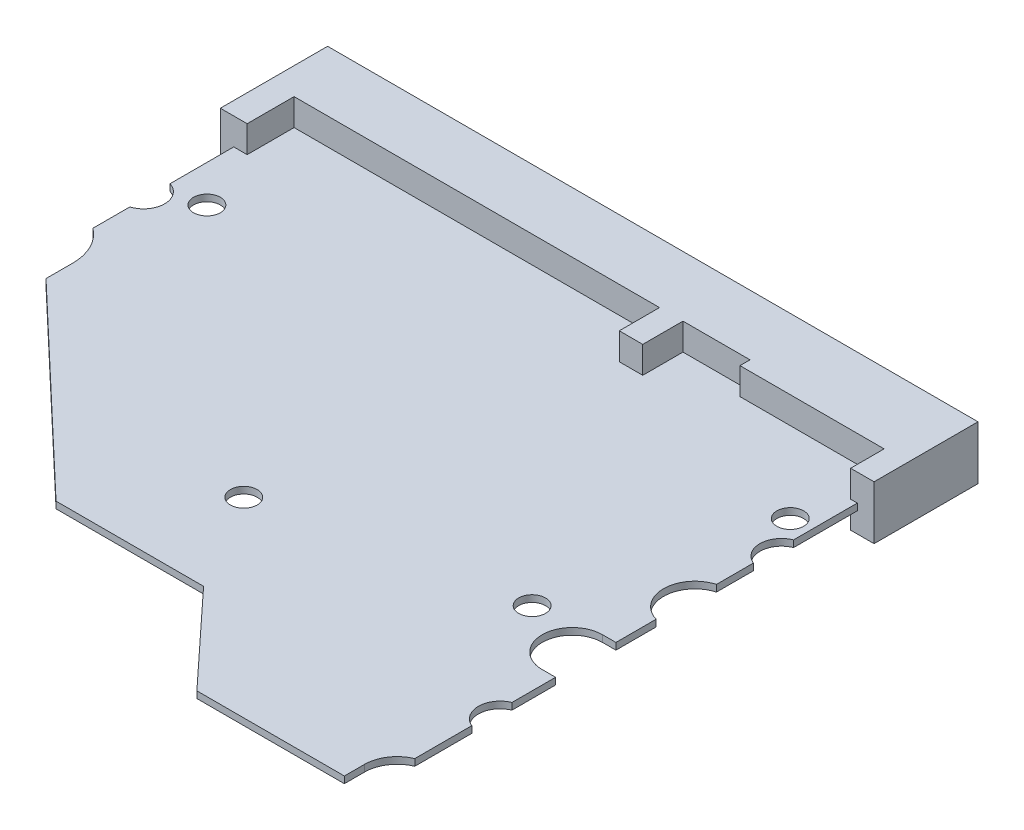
ISO-10303-21;
HEADER;
FILE_DESCRIPTION(('STEP AP214'),'2;1');
FILE_NAME('part.step','',(''),(''),'','','');
FILE_SCHEMA(('AUTOMOTIVE_DESIGN { 1 0 10303 214 1 1 1 1 }'));
ENDSEC;
DATA;
#1=APPLICATION_CONTEXT('core data for automotive mechanical design processes');
#2=APPLICATION_PROTOCOL_DEFINITION('international standard','automotive_design',2000,#1);
#3=PRODUCT_CONTEXT('',#1,'mechanical');
#4=PRODUCT('Part','Part','',(#3));
#5=PRODUCT_RELATED_PRODUCT_CATEGORY('part','',(#4));
#6=PRODUCT_DEFINITION_FORMATION('','',#4);
#7=PRODUCT_DEFINITION_CONTEXT('part definition',#1,'design');
#8=PRODUCT_DEFINITION('design','',#6,#7);
#9=PRODUCT_DEFINITION_SHAPE('','',#8);
#10=(LENGTH_UNIT() NAMED_UNIT(*) SI_UNIT(.MILLI.,.METRE.));
#11=(NAMED_UNIT(*) PLANE_ANGLE_UNIT() SI_UNIT($,.RADIAN.));
#12=(NAMED_UNIT(*) SI_UNIT($,.STERADIAN.) SOLID_ANGLE_UNIT());
#13=UNCERTAINTY_MEASURE_WITH_UNIT(LENGTH_MEASURE(1.E-05),#10,'distance_accuracy_value','');
#14=(GEOMETRIC_REPRESENTATION_CONTEXT(3) GLOBAL_UNCERTAINTY_ASSIGNED_CONTEXT((#13)) GLOBAL_UNIT_ASSIGNED_CONTEXT((#10,
#11,#12)) REPRESENTATION_CONTEXT('',''));
#15=CARTESIAN_POINT('',(0.,0.,0.));
#16=DIRECTION('',(0.,0.,1.));
#17=DIRECTION('',(1.,0.,0.));
#18=AXIS2_PLACEMENT_3D('',#15,#16,#17);
#19=CARTESIAN_POINT('',(48.5,8.,44.5));
#20=DIRECTION('',(-1.,0.,0.));
#21=DIRECTION('',(0.,0.,1.));
#22=AXIS2_PLACEMENT_3D('',#19,#20,#21);
#23=PLANE('',#22);
#24=DIRECTION('',(0.,1.,0.));
#25=VECTOR('',#24,1.);
#26=CARTESIAN_POINT('',(48.5,4.,-29.));
#27=LINE('',#26,#25);
#28=CARTESIAN_POINT('',(48.5,0.,-29.));
#29=VERTEX_POINT('',#28);
#30=CARTESIAN_POINT('',(48.5,8.,-29.));
#31=VERTEX_POINT('',#30);
#32=EDGE_CURVE('E506',#29,#31,#27,.T.);
#33=ORIENTED_EDGE('',*,*,#32,.F.);
#34=DIRECTION('',(0.,0.,-1.));
#35=VECTOR('',#34,1.);
#36=CARTESIAN_POINT('',(48.5,0.,44.5));
#37=LINE('',#36,#35);
#38=CARTESIAN_POINT('',(48.5,0.,-44.5));
#39=VERTEX_POINT('',#38);
#40=EDGE_CURVE('E550',#29,#39,#37,.T.);
#41=ORIENTED_EDGE('',*,*,#40,.T.);
#42=DIRECTION('',(0.,-1.,0.));
#43=VECTOR('',#42,1.);
#44=CARTESIAN_POINT('',(48.5,8.,-44.5));
#45=LINE('',#44,#43);
#46=CARTESIAN_POINT('',(48.5,8.,-44.5));
#47=VERTEX_POINT('',#46);
#48=EDGE_CURVE('E11',#47,#39,#45,.T.);
#49=ORIENTED_EDGE('',*,*,#48,.F.);
#50=DIRECTION('',(0.,0.,-1.));
#51=VECTOR('',#50,1.);
#52=CARTESIAN_POINT('',(48.5,8.,44.5));
#53=LINE('',#52,#51);
#54=EDGE_CURVE('E583',#31,#47,#53,.T.);
#55=ORIENTED_EDGE('',*,*,#54,.F.);
#56=EDGE_LOOP('',(#33,#41,#49,#55));
#57=FACE_BOUND('',#56,.T.);
#58=ADVANCED_FACE('F42',(#57),#23,.F.);
#59=CARTESIAN_POINT('',(-48.5,8.,-44.5));
#60=DIRECTION('',(0.,0.,1.));
#61=DIRECTION('',(1.,0.,0.));
#62=AXIS2_PLACEMENT_3D('',#59,#60,#61);
#63=PLANE('',#62);
#64=DIRECTION('',(-1.,0.,0.));
#65=VECTOR('',#64,1.);
#66=CARTESIAN_POINT('',(-48.5,0.,-44.5));
#67=LINE('',#66,#65);
#68=CARTESIAN_POINT('',(-48.5,0.,-44.5));
#69=VERTEX_POINT('',#68);
#70=EDGE_CURVE('E596',#39,#69,#67,.T.);
#71=ORIENTED_EDGE('',*,*,#70,.T.);
#72=DIRECTION('',(0.,-1.,0.));
#73=VECTOR('',#72,1.);
#74=CARTESIAN_POINT('',(-48.5,8.,-44.5));
#75=LINE('',#74,#73);
#76=CARTESIAN_POINT('',(-48.5,8.,-44.5));
#77=VERTEX_POINT('',#76);
#78=EDGE_CURVE('E50',#77,#69,#75,.T.);
#79=ORIENTED_EDGE('',*,*,#78,.F.);
#80=DIRECTION('',(-1.,0.,0.));
#81=VECTOR('',#80,1.);
#82=CARTESIAN_POINT('',(-48.5,8.,-44.5));
#83=LINE('',#82,#81);
#84=EDGE_CURVE('E586',#47,#77,#83,.T.);
#85=ORIENTED_EDGE('',*,*,#84,.F.);
#86=ORIENTED_EDGE('',*,*,#48,.T.);
#87=EDGE_LOOP('',(#71,#79,#85,#86));
#88=FACE_BOUND('',#87,.T.);
#89=ADVANCED_FACE('F947',(#88),#63,.F.);
#90=CARTESIAN_POINT('',(-48.5,8.,44.5));
#91=DIRECTION('',(1.,0.,0.));
#92=DIRECTION('',(0.,0.,-1.));
#93=AXIS2_PLACEMENT_3D('',#90,#91,#92);
#94=PLANE('',#93);
#95=DIRECTION('',(0.,0.,1.));
#96=VECTOR('',#95,1.);
#97=CARTESIAN_POINT('',(-48.5,0.,44.5));
#98=LINE('',#97,#96);
#99=CARTESIAN_POINT('',(-48.5,0.,-28.5));
#100=VERTEX_POINT('',#99);
#101=EDGE_CURVE('E587',#69,#100,#98,.T.);
#102=ORIENTED_EDGE('',*,*,#101,.T.);
#103=DIRECTION('',(0.,1.,0.));
#104=VECTOR('',#103,1.);
#105=CARTESIAN_POINT('',(-48.5,4.,-28.5));
#106=LINE('',#105,#104);
#107=CARTESIAN_POINT('',(-48.5,8.,-28.5));
#108=VERTEX_POINT('',#107);
#109=EDGE_CURVE('E65',#100,#108,#106,.T.);
#110=ORIENTED_EDGE('',*,*,#109,.T.);
#111=DIRECTION('',(0.,0.,1.));
#112=VECTOR('',#111,1.);
#113=CARTESIAN_POINT('',(-48.5,8.,44.5));
#114=LINE('',#113,#112);
#115=EDGE_CURVE('E590',#77,#108,#114,.T.);
#116=ORIENTED_EDGE('',*,*,#115,.F.);
#117=ORIENTED_EDGE('',*,*,#78,.T.);
#118=EDGE_LOOP('',(#102,#110,#116,#117));
#119=FACE_BOUND('',#118,.T.);
#120=ADVANCED_FACE('F607',(#119),#94,.F.);
#121=CARTESIAN_POINT('',(-48.5,8.,44.5));
#122=DIRECTION('',(0.,0.,-1.));
#123=DIRECTION('',(-1.,0.,0.));
#124=AXIS2_PLACEMENT_3D('',#121,#122,#123);
#125=PLANE('',#124);
#126=DIRECTION('',(1.,0.,0.));
#127=VECTOR('',#126,1.);
#128=CARTESIAN_POINT('',(48.5,4.,44.5));
#129=LINE('',#128,#127);
#130=CARTESIAN_POINT('',(21.,4.,44.5));
#131=VERTEX_POINT('',#130);
#132=CARTESIAN_POINT('',(43.,4.,44.5));
#133=VERTEX_POINT('',#132);
#134=EDGE_CURVE('E460',#131,#133,#129,.T.);
#135=ORIENTED_EDGE('',*,*,#134,.F.);
#136=DIRECTION('',(0.,-1.,0.));
#137=VECTOR('',#136,1.);
#138=CARTESIAN_POINT('',(21.,6.5,44.5));
#139=LINE('',#138,#137);
#140=CARTESIAN_POINT('',(21.,3.,44.5));
#141=VERTEX_POINT('',#140);
#142=EDGE_CURVE('E833',#131,#141,#139,.T.);
#143=ORIENTED_EDGE('',*,*,#142,.T.);
#144=DIRECTION('',(-1.,0.,0.));
#145=VECTOR('',#144,1.);
#146=CARTESIAN_POINT('',(-48.5,3.,44.5));
#147=LINE('',#146,#145);
#148=CARTESIAN_POINT('',(43.,3.,44.5));
#149=VERTEX_POINT('',#148);
#150=EDGE_CURVE('E364',#149,#141,#147,.T.);
#151=ORIENTED_EDGE('',*,*,#150,.F.);
#152=DIRECTION('',(0.,-1.,0.));
#153=VECTOR('',#152,1.);
#154=CARTESIAN_POINT('',(43.,6.5,44.5));
#155=LINE('',#154,#153);
#156=EDGE_CURVE('E57',#133,#149,#155,.T.);
#157=ORIENTED_EDGE('',*,*,#156,.F.);
#158=EDGE_LOOP('',(#135,#143,#151,#157));
#159=FACE_BOUND('',#158,.T.);
#160=ADVANCED_FACE('F1019',(#159),#125,.F.);
#161=CARTESIAN_POINT('',(0.,8.,0.));
#162=DIRECTION('',(0.,-1.,0.));
#163=DIRECTION('',(0.,0.,-1.));
#164=AXIS2_PLACEMENT_3D('',#161,#162,#163);
#165=PLANE('',#164);
#166=ORIENTED_EDGE('',*,*,#115,.T.);
#167=DIRECTION('',(-1.,0.,0.));
#168=VECTOR('',#167,1.);
#169=CARTESIAN_POINT('',(-48.5,8.,-28.5));
#170=LINE('',#169,#168);
#171=CARTESIAN_POINT('',(-44.5,8.,-28.5));
#172=VERTEX_POINT('',#171);
#173=EDGE_CURVE('E464',#172,#108,#170,.T.);
#174=ORIENTED_EDGE('',*,*,#173,.F.);
#175=DIRECTION('',(0.,0.,1.));
#176=VECTOR('',#175,1.);
#177=CARTESIAN_POINT('',(-44.5,8.,-28.5));
#178=LINE('',#177,#176);
#179=CARTESIAN_POINT('',(-44.5,8.,-35.5));
#180=VERTEX_POINT('',#179);
#181=EDGE_CURVE('E542',#180,#172,#178,.T.);
#182=ORIENTED_EDGE('',*,*,#181,.F.);
#183=DIRECTION('',(-1.,0.,0.));
#184=VECTOR('',#183,1.);
#185=CARTESIAN_POINT('',(-44.5,8.,-35.5));
#186=LINE('',#185,#184);
#187=CARTESIAN_POINT('',(10.,8.,-35.5));
#188=VERTEX_POINT('',#187);
#189=EDGE_CURVE('E538',#188,#180,#186,.T.);
#190=ORIENTED_EDGE('',*,*,#189,.F.);
#191=DIRECTION('',(0.,0.,-1.));
#192=VECTOR('',#191,1.);
#193=CARTESIAN_POINT('',(10.,8.,-35.5));
#194=LINE('',#193,#192);
#195=CARTESIAN_POINT('',(10.,8.,-29.5));
#196=VERTEX_POINT('',#195);
#197=EDGE_CURVE('E534',#196,#188,#194,.T.);
#198=ORIENTED_EDGE('',*,*,#197,.F.);
#199=DIRECTION('',(-1.,0.,0.));
#200=VECTOR('',#199,1.);
#201=CARTESIAN_POINT('',(10.,8.,-29.5));
#202=LINE('',#201,#200);
#203=CARTESIAN_POINT('',(13.5,8.,-29.5));
#204=VERTEX_POINT('',#203);
#205=EDGE_CURVE('E530',#204,#196,#202,.T.);
#206=ORIENTED_EDGE('',*,*,#205,.F.);
#207=DIRECTION('',(0.,0.,1.));
#208=VECTOR('',#207,1.);
#209=CARTESIAN_POINT('',(13.5,8.,-29.5));
#210=LINE('',#209,#208);
#211=CARTESIAN_POINT('',(13.5,8.,-35.5));
#212=VERTEX_POINT('',#211);
#213=EDGE_CURVE('E526',#212,#204,#210,.T.);
#214=ORIENTED_EDGE('',*,*,#213,.F.);
#215=DIRECTION('',(-1.,0.,0.));
#216=VECTOR('',#215,1.);
#217=CARTESIAN_POINT('',(13.5,8.,-35.5));
#218=LINE('',#217,#216);
#219=CARTESIAN_POINT('',(23.5,8.,-35.5));
#220=VERTEX_POINT('',#219);
#221=EDGE_CURVE('E522',#220,#212,#218,.T.);
#222=ORIENTED_EDGE('',*,*,#221,.F.);
#223=DIRECTION('',(0.,0.,-1.));
#224=VECTOR('',#223,1.);
#225=CARTESIAN_POINT('',(23.5,8.,-35.5));
#226=LINE('',#225,#224);
#227=CARTESIAN_POINT('',(23.5,8.,-34.));
#228=VERTEX_POINT('',#227);
#229=EDGE_CURVE('E518',#228,#220,#226,.T.);
#230=ORIENTED_EDGE('',*,*,#229,.F.);
#231=DIRECTION('',(-1.,0.,0.));
#232=VECTOR('',#231,1.);
#233=CARTESIAN_POINT('',(23.5,8.,-34.));
#234=LINE('',#233,#232);
#235=CARTESIAN_POINT('',(45.,8.,-34.));
#236=VERTEX_POINT('',#235);
#237=EDGE_CURVE('E514',#236,#228,#234,.T.);
#238=ORIENTED_EDGE('',*,*,#237,.F.);
#239=DIRECTION('',(0.,0.,-1.));
#240=VECTOR('',#239,1.);
#241=CARTESIAN_POINT('',(45.,8.,-34.));
#242=LINE('',#241,#240);
#243=CARTESIAN_POINT('',(45.,8.,-29.));
#244=VERTEX_POINT('',#243);
#245=EDGE_CURVE('E510',#244,#236,#242,.T.);
#246=ORIENTED_EDGE('',*,*,#245,.F.);
#247=DIRECTION('',(-1.,0.,0.));
#248=VECTOR('',#247,1.);
#249=CARTESIAN_POINT('',(45.,8.,-29.));
#250=LINE('',#249,#248);
#251=EDGE_CURVE('E439',#31,#244,#250,.T.);
#252=ORIENTED_EDGE('',*,*,#251,.F.);
#253=ORIENTED_EDGE('',*,*,#54,.T.);
#254=ORIENTED_EDGE('',*,*,#84,.T.);
#255=EDGE_LOOP('',(#166,#174,#182,#190,#198,#206,#214,#222,#230,#238,#246,#252,#253,#254));
#256=FACE_BOUND('',#255,.T.);
#257=ADVANCED_FACE('F957',(#256),#165,.F.);
#258=CARTESIAN_POINT('',(0.,0.,0.));
#259=DIRECTION('',(0.,-1.,0.));
#260=DIRECTION('',(0.,0.,-1.));
#261=AXIS2_PLACEMENT_3D('',#258,#259,#260);
#262=PLANE('',#261);
#263=DIRECTION('',(1.,0.,0.));
#264=VECTOR('',#263,1.);
#265=CARTESIAN_POINT('',(48.5,0.,-29.));
#266=LINE('',#265,#264);
#267=CARTESIAN_POINT('',(45.,0.,-29.));
#268=VERTEX_POINT('',#267);
#269=EDGE_CURVE('E370',#268,#29,#266,.T.);
#270=ORIENTED_EDGE('',*,*,#269,.F.);
#271=DIRECTION('',(0.,0.,1.));
#272=VECTOR('',#271,1.);
#273=CARTESIAN_POINT('',(45.,0.,-29.));
#274=LINE('',#273,#272);
#275=CARTESIAN_POINT('',(45.,0.,-37.));
#276=VERTEX_POINT('',#275);
#277=EDGE_CURVE('E429',#276,#268,#274,.T.);
#278=ORIENTED_EDGE('',*,*,#277,.F.);
#279=DIRECTION('',(1.,0.,0.));
#280=VECTOR('',#279,1.);
#281=CARTESIAN_POINT('',(45.,0.,-37.));
#282=LINE('',#281,#280);
#283=CARTESIAN_POINT('',(13.5,0.,-37.));
#284=VERTEX_POINT('',#283);
#285=EDGE_CURVE('E425',#284,#276,#282,.T.);
#286=ORIENTED_EDGE('',*,*,#285,.F.);
#287=DIRECTION('',(0.,0.,-1.));
#288=VECTOR('',#287,1.);
#289=CARTESIAN_POINT('',(13.5,0.,-37.));
#290=LINE('',#289,#288);
#291=CARTESIAN_POINT('',(13.5,0.,-30.));
#292=VERTEX_POINT('',#291);
#293=EDGE_CURVE('E421',#292,#284,#290,.T.);
#294=ORIENTED_EDGE('',*,*,#293,.F.);
#295=DIRECTION('',(1.,0.,0.));
#296=VECTOR('',#295,1.);
#297=CARTESIAN_POINT('',(13.5,0.,-30.));
#298=LINE('',#297,#296);
#299=CARTESIAN_POINT('',(10.,0.,-30.));
#300=VERTEX_POINT('',#299);
#301=EDGE_CURVE('E417',#300,#292,#298,.T.);
#302=ORIENTED_EDGE('',*,*,#301,.F.);
#303=DIRECTION('',(0.,0.,1.));
#304=VECTOR('',#303,1.);
#305=CARTESIAN_POINT('',(10.,0.,-30.));
#306=LINE('',#305,#304);
#307=CARTESIAN_POINT('',(10.,0.,-37.));
#308=VERTEX_POINT('',#307);
#309=EDGE_CURVE('E413',#308,#300,#306,.T.);
#310=ORIENTED_EDGE('',*,*,#309,.F.);
#311=DIRECTION('',(1.,0.,0.));
#312=VECTOR('',#311,1.);
#313=CARTESIAN_POINT('',(10.,0.,-37.));
#314=LINE('',#313,#312);
#315=CARTESIAN_POINT('',(-44.5,0.,-37.));
#316=VERTEX_POINT('',#315);
#317=EDGE_CURVE('E409',#316,#308,#314,.T.);
#318=ORIENTED_EDGE('',*,*,#317,.F.);
#319=DIRECTION('',(0.,0.,-1.));
#320=VECTOR('',#319,1.);
#321=CARTESIAN_POINT('',(-44.5,0.,-37.));
#322=LINE('',#321,#320);
#323=CARTESIAN_POINT('',(-44.5,0.,-28.5));
#324=VERTEX_POINT('',#323);
#325=EDGE_CURVE('E404',#324,#316,#322,.T.);
#326=ORIENTED_EDGE('',*,*,#325,.F.);
#327=DIRECTION('',(1.,0.,0.));
#328=VECTOR('',#327,1.);
#329=CARTESIAN_POINT('',(-44.5,0.,-28.5));
#330=LINE('',#329,#328);
#331=EDGE_CURVE('E401',#100,#324,#330,.T.);
#332=ORIENTED_EDGE('',*,*,#331,.F.);
#333=ORIENTED_EDGE('',*,*,#101,.F.);
#334=ORIENTED_EDGE('',*,*,#70,.F.);
#335=ORIENTED_EDGE('',*,*,#40,.F.);
#336=EDGE_LOOP('',(#270,#278,#286,#294,#302,#310,#318,#326,#332,#333,#334,#335));
#337=FACE_BOUND('',#336,.T.);
#338=ADVANCED_FACE('F613',(#337),#262,.T.);
#339=CARTESIAN_POINT('',(-48.5,4.,-28.5));
#340=DIRECTION('',(0.,0.,-1.));
#341=DIRECTION('',(-1.,0.,0.));
#342=AXIS2_PLACEMENT_3D('',#339,#340,#341);
#343=PLANE('',#342);
#344=DIRECTION('',(0.,-1.,0.));
#345=VECTOR('',#344,1.);
#346=CARTESIAN_POINT('',(-46.5,6.5,-28.5));
#347=LINE('',#346,#345);
#348=CARTESIAN_POINT('',(-46.5,4.,-28.5));
#349=VERTEX_POINT('',#348);
#350=CARTESIAN_POINT('',(-46.5,3.,-28.5));
#351=VERTEX_POINT('',#350);
#352=EDGE_CURVE('E332',#349,#351,#347,.T.);
#353=ORIENTED_EDGE('',*,*,#352,.F.);
#354=DIRECTION('',(-1.,0.,0.));
#355=VECTOR('',#354,1.);
#356=CARTESIAN_POINT('',(-48.5,4.,-28.5));
#357=LINE('',#356,#355);
#358=CARTESIAN_POINT('',(-44.5,4.,-28.5));
#359=VERTEX_POINT('',#358);
#360=EDGE_CURVE('E503',#359,#349,#357,.T.);
#361=ORIENTED_EDGE('',*,*,#360,.F.);
#362=DIRECTION('',(0.,1.,0.));
#363=VECTOR('',#362,1.);
#364=CARTESIAN_POINT('',(-44.5,4.,-28.5));
#365=LINE('',#364,#363);
#366=EDGE_CURVE('E551',#359,#172,#365,.T.);
#367=ORIENTED_EDGE('',*,*,#366,.T.);
#368=ORIENTED_EDGE('',*,*,#173,.T.);
#369=ORIENTED_EDGE('',*,*,#109,.F.);
#370=ORIENTED_EDGE('',*,*,#331,.T.);
#371=DIRECTION('',(0.,-1.,0.));
#372=VECTOR('',#371,1.);
#373=CARTESIAN_POINT('',(-44.5,3.,-28.5));
#374=LINE('',#373,#372);
#375=CARTESIAN_POINT('',(-44.5,3.,-28.5));
#376=VERTEX_POINT('',#375);
#377=EDGE_CURVE('E360',#376,#324,#374,.T.);
#378=ORIENTED_EDGE('',*,*,#377,.F.);
#379=DIRECTION('',(1.,0.,0.));
#380=VECTOR('',#379,1.);
#381=CARTESIAN_POINT('',(-44.5,3.,-28.5));
#382=LINE('',#381,#380);
#383=EDGE_CURVE('E351',#351,#376,#382,.T.);
#384=ORIENTED_EDGE('',*,*,#383,.F.);
#385=EDGE_LOOP('',(#353,#361,#367,#368,#369,#370,#378,#384));
#386=FACE_BOUND('',#385,.T.);
#387=ADVANCED_FACE('F359',(#386),#343,.F.);
#388=CARTESIAN_POINT('',(-44.5,4.,-28.5));
#389=DIRECTION('',(-1.,0.,0.));
#390=DIRECTION('',(0.,0.,1.));
#391=AXIS2_PLACEMENT_3D('',#388,#389,#390);
#392=PLANE('',#391);
#393=ORIENTED_EDGE('',*,*,#181,.T.);
#394=ORIENTED_EDGE('',*,*,#366,.F.);
#395=DIRECTION('',(0.,0.,1.));
#396=VECTOR('',#395,1.);
#397=CARTESIAN_POINT('',(-44.5,4.,-28.5));
#398=LINE('',#397,#396);
#399=CARTESIAN_POINT('',(-44.5,4.,-35.5));
#400=VERTEX_POINT('',#399);
#401=EDGE_CURVE('E499',#400,#359,#398,.T.);
#402=ORIENTED_EDGE('',*,*,#401,.F.);
#403=DIRECTION('',(0.,1.,0.));
#404=VECTOR('',#403,1.);
#405=CARTESIAN_POINT('',(-44.5,4.,-35.5));
#406=LINE('',#405,#404);
#407=EDGE_CURVE('E554',#400,#180,#406,.T.);
#408=ORIENTED_EDGE('',*,*,#407,.T.);
#409=EDGE_LOOP('',(#393,#394,#402,#408));
#410=FACE_BOUND('',#409,.T.);
#411=ADVANCED_FACE('F991',(#410),#392,.F.);
#412=CARTESIAN_POINT('',(-44.5,4.,-35.5));
#413=DIRECTION('',(0.,0.,-1.));
#414=DIRECTION('',(-1.,0.,0.));
#415=AXIS2_PLACEMENT_3D('',#412,#413,#414);
#416=PLANE('',#415);
#417=ORIENTED_EDGE('',*,*,#189,.T.);
#418=ORIENTED_EDGE('',*,*,#407,.F.);
#419=DIRECTION('',(-1.,0.,0.));
#420=VECTOR('',#419,1.);
#421=CARTESIAN_POINT('',(-44.5,4.,-35.5));
#422=LINE('',#421,#420);
#423=CARTESIAN_POINT('',(10.,4.,-35.5));
#424=VERTEX_POINT('',#423);
#425=EDGE_CURVE('E495',#424,#400,#422,.T.);
#426=ORIENTED_EDGE('',*,*,#425,.F.);
#427=DIRECTION('',(0.,1.,0.));
#428=VECTOR('',#427,1.);
#429=CARTESIAN_POINT('',(10.,4.,-35.5));
#430=LINE('',#429,#428);
#431=EDGE_CURVE('E557',#424,#188,#430,.T.);
#432=ORIENTED_EDGE('',*,*,#431,.T.);
#433=EDGE_LOOP('',(#417,#418,#426,#432));
#434=FACE_BOUND('',#433,.T.);
#435=ADVANCED_FACE('F987',(#434),#416,.F.);
#436=CARTESIAN_POINT('',(10.,4.,-35.5));
#437=DIRECTION('',(1.,0.,0.));
#438=DIRECTION('',(0.,0.,-1.));
#439=AXIS2_PLACEMENT_3D('',#436,#437,#438);
#440=PLANE('',#439);
#441=ORIENTED_EDGE('',*,*,#197,.T.);
#442=ORIENTED_EDGE('',*,*,#431,.F.);
#443=DIRECTION('',(0.,0.,-1.));
#444=VECTOR('',#443,1.);
#445=CARTESIAN_POINT('',(10.,4.,-35.5));
#446=LINE('',#445,#444);
#447=CARTESIAN_POINT('',(10.,4.,-29.5));
#448=VERTEX_POINT('',#447);
#449=EDGE_CURVE('E491',#448,#424,#446,.T.);
#450=ORIENTED_EDGE('',*,*,#449,.F.);
#451=DIRECTION('',(0.,1.,0.));
#452=VECTOR('',#451,1.);
#453=CARTESIAN_POINT('',(10.,4.,-29.5));
#454=LINE('',#453,#452);
#455=EDGE_CURVE('E560',#448,#196,#454,.T.);
#456=ORIENTED_EDGE('',*,*,#455,.T.);
#457=EDGE_LOOP('',(#441,#442,#450,#456));
#458=FACE_BOUND('',#457,.T.);
#459=ADVANCED_FACE('F983',(#458),#440,.F.);
#460=CARTESIAN_POINT('',(10.,4.,-29.5));
#461=DIRECTION('',(0.,0.,-1.));
#462=DIRECTION('',(-1.,0.,0.));
#463=AXIS2_PLACEMENT_3D('',#460,#461,#462);
#464=PLANE('',#463);
#465=ORIENTED_EDGE('',*,*,#205,.T.);
#466=ORIENTED_EDGE('',*,*,#455,.F.);
#467=DIRECTION('',(-1.,0.,0.));
#468=VECTOR('',#467,1.);
#469=CARTESIAN_POINT('',(10.,4.,-29.5));
#470=LINE('',#469,#468);
#471=CARTESIAN_POINT('',(13.5,4.,-29.5));
#472=VERTEX_POINT('',#471);
#473=EDGE_CURVE('E487',#472,#448,#470,.T.);
#474=ORIENTED_EDGE('',*,*,#473,.F.);
#475=DIRECTION('',(0.,1.,0.));
#476=VECTOR('',#475,1.);
#477=CARTESIAN_POINT('',(13.5,4.,-29.5));
#478=LINE('',#477,#476);
#479=EDGE_CURVE('E563',#472,#204,#478,.T.);
#480=ORIENTED_EDGE('',*,*,#479,.T.);
#481=EDGE_LOOP('',(#465,#466,#474,#480));
#482=FACE_BOUND('',#481,.T.);
#483=ADVANCED_FACE('F979',(#482),#464,.F.);
#484=CARTESIAN_POINT('',(13.5,4.,-29.5));
#485=DIRECTION('',(-1.,0.,0.));
#486=DIRECTION('',(0.,0.,1.));
#487=AXIS2_PLACEMENT_3D('',#484,#485,#486);
#488=PLANE('',#487);
#489=ORIENTED_EDGE('',*,*,#213,.T.);
#490=ORIENTED_EDGE('',*,*,#479,.F.);
#491=DIRECTION('',(0.,0.,1.));
#492=VECTOR('',#491,1.);
#493=CARTESIAN_POINT('',(13.5,4.,-29.5));
#494=LINE('',#493,#492);
#495=CARTESIAN_POINT('',(13.5,4.,-35.5));
#496=VERTEX_POINT('',#495);
#497=EDGE_CURVE('E483',#496,#472,#494,.T.);
#498=ORIENTED_EDGE('',*,*,#497,.F.);
#499=DIRECTION('',(0.,1.,0.));
#500=VECTOR('',#499,1.);
#501=CARTESIAN_POINT('',(13.5,4.,-35.5));
#502=LINE('',#501,#500);
#503=EDGE_CURVE('E566',#496,#212,#502,.T.);
#504=ORIENTED_EDGE('',*,*,#503,.T.);
#505=EDGE_LOOP('',(#489,#490,#498,#504));
#506=FACE_BOUND('',#505,.T.);
#507=ADVANCED_FACE('F975',(#506),#488,.F.);
#508=CARTESIAN_POINT('',(13.5,4.,-35.5));
#509=DIRECTION('',(0.,0.,-1.));
#510=DIRECTION('',(-1.,0.,0.));
#511=AXIS2_PLACEMENT_3D('',#508,#509,#510);
#512=PLANE('',#511);
#513=ORIENTED_EDGE('',*,*,#221,.T.);
#514=ORIENTED_EDGE('',*,*,#503,.F.);
#515=DIRECTION('',(-1.,0.,0.));
#516=VECTOR('',#515,1.);
#517=CARTESIAN_POINT('',(13.5,4.,-35.5));
#518=LINE('',#517,#516);
#519=CARTESIAN_POINT('',(23.5,4.,-35.5));
#520=VERTEX_POINT('',#519);
#521=EDGE_CURVE('E479',#520,#496,#518,.T.);
#522=ORIENTED_EDGE('',*,*,#521,.F.);
#523=DIRECTION('',(0.,1.,0.));
#524=VECTOR('',#523,1.);
#525=CARTESIAN_POINT('',(23.5,4.,-35.5));
#526=LINE('',#525,#524);
#527=EDGE_CURVE('E569',#520,#220,#526,.T.);
#528=ORIENTED_EDGE('',*,*,#527,.T.);
#529=EDGE_LOOP('',(#513,#514,#522,#528));
#530=FACE_BOUND('',#529,.T.);
#531=ADVANCED_FACE('F971',(#530),#512,.F.);
#532=CARTESIAN_POINT('',(23.5,4.,-35.5));
#533=DIRECTION('',(1.,0.,0.));
#534=DIRECTION('',(0.,0.,-1.));
#535=AXIS2_PLACEMENT_3D('',#532,#533,#534);
#536=PLANE('',#535);
#537=ORIENTED_EDGE('',*,*,#229,.T.);
#538=ORIENTED_EDGE('',*,*,#527,.F.);
#539=DIRECTION('',(0.,0.,-1.));
#540=VECTOR('',#539,1.);
#541=CARTESIAN_POINT('',(23.5,4.,-35.5));
#542=LINE('',#541,#540);
#543=CARTESIAN_POINT('',(23.5,4.,-34.));
#544=VERTEX_POINT('',#543);
#545=EDGE_CURVE('E475',#544,#520,#542,.T.);
#546=ORIENTED_EDGE('',*,*,#545,.F.);
#547=DIRECTION('',(0.,1.,0.));
#548=VECTOR('',#547,1.);
#549=CARTESIAN_POINT('',(23.5,4.,-34.));
#550=LINE('',#549,#548);
#551=EDGE_CURVE('E572',#544,#228,#550,.T.);
#552=ORIENTED_EDGE('',*,*,#551,.T.);
#553=EDGE_LOOP('',(#537,#538,#546,#552));
#554=FACE_BOUND('',#553,.T.);
#555=ADVANCED_FACE('F967',(#554),#536,.F.);
#556=CARTESIAN_POINT('',(23.5,4.,-34.));
#557=DIRECTION('',(0.,0.,-1.));
#558=DIRECTION('',(-1.,0.,0.));
#559=AXIS2_PLACEMENT_3D('',#556,#557,#558);
#560=PLANE('',#559);
#561=ORIENTED_EDGE('',*,*,#237,.T.);
#562=ORIENTED_EDGE('',*,*,#551,.F.);
#563=DIRECTION('',(-1.,0.,0.));
#564=VECTOR('',#563,1.);
#565=CARTESIAN_POINT('',(23.5,4.,-34.));
#566=LINE('',#565,#564);
#567=CARTESIAN_POINT('',(45.,4.,-34.));
#568=VERTEX_POINT('',#567);
#569=EDGE_CURVE('E471',#568,#544,#566,.T.);
#570=ORIENTED_EDGE('',*,*,#569,.F.);
#571=DIRECTION('',(0.,1.,0.));
#572=VECTOR('',#571,1.);
#573=CARTESIAN_POINT('',(45.,4.,-34.));
#574=LINE('',#573,#572);
#575=EDGE_CURVE('E575',#568,#236,#574,.T.);
#576=ORIENTED_EDGE('',*,*,#575,.T.);
#577=EDGE_LOOP('',(#561,#562,#570,#576));
#578=FACE_BOUND('',#577,.T.);
#579=ADVANCED_FACE('F965',(#578),#560,.F.);
#580=CARTESIAN_POINT('',(45.,4.,-34.));
#581=DIRECTION('',(1.,0.,0.));
#582=DIRECTION('',(0.,0.,-1.));
#583=AXIS2_PLACEMENT_3D('',#580,#581,#582);
#584=PLANE('',#583);
#585=ORIENTED_EDGE('',*,*,#245,.T.);
#586=ORIENTED_EDGE('',*,*,#575,.F.);
#587=DIRECTION('',(0.,0.,-1.));
#588=VECTOR('',#587,1.);
#589=CARTESIAN_POINT('',(45.,4.,-34.));
#590=LINE('',#589,#588);
#591=CARTESIAN_POINT('',(45.,4.,-29.));
#592=VERTEX_POINT('',#591);
#593=EDGE_CURVE('E467',#592,#568,#590,.T.);
#594=ORIENTED_EDGE('',*,*,#593,.F.);
#595=DIRECTION('',(0.,1.,0.));
#596=VECTOR('',#595,1.);
#597=CARTESIAN_POINT('',(45.,4.,-29.));
#598=LINE('',#597,#596);
#599=EDGE_CURVE('E578',#592,#244,#598,.T.);
#600=ORIENTED_EDGE('',*,*,#599,.T.);
#601=EDGE_LOOP('',(#585,#586,#594,#600));
#602=FACE_BOUND('',#601,.T.);
#603=ADVANCED_FACE('F941',(#602),#584,.F.);
#604=CARTESIAN_POINT('',(45.,4.,-29.));
#605=DIRECTION('',(0.,0.,-1.));
#606=DIRECTION('',(-1.,0.,0.));
#607=AXIS2_PLACEMENT_3D('',#604,#605,#606);
#608=PLANE('',#607);
#609=DIRECTION('',(-1.,0.,0.));
#610=VECTOR('',#609,1.);
#611=CARTESIAN_POINT('',(45.,4.,-29.));
#612=LINE('',#611,#610);
#613=CARTESIAN_POINT('',(46.,4.,-29.));
#614=VERTEX_POINT('',#613);
#615=EDGE_CURVE('E463',#614,#592,#612,.T.);
#616=ORIENTED_EDGE('',*,*,#615,.F.);
#617=DIRECTION('',(0.,-1.,0.));
#618=VECTOR('',#617,1.);
#619=CARTESIAN_POINT('',(46.,6.5,-29.));
#620=LINE('',#619,#618);
#621=CARTESIAN_POINT('',(46.,3.,-29.));
#622=VERTEX_POINT('',#621);
#623=EDGE_CURVE('E650',#614,#622,#620,.T.);
#624=ORIENTED_EDGE('',*,*,#623,.T.);
#625=DIRECTION('',(1.,0.,0.));
#626=VECTOR('',#625,1.);
#627=CARTESIAN_POINT('',(48.5,3.,-29.));
#628=LINE('',#627,#626);
#629=CARTESIAN_POINT('',(45.,3.,-29.));
#630=VERTEX_POINT('',#629);
#631=EDGE_CURVE('E397',#630,#622,#628,.T.);
#632=ORIENTED_EDGE('',*,*,#631,.F.);
#633=DIRECTION('',(0.,-1.,0.));
#634=VECTOR('',#633,1.);
#635=CARTESIAN_POINT('',(45.,3.,-29.));
#636=LINE('',#635,#634);
#637=EDGE_CURVE('E436',#630,#268,#636,.T.);
#638=ORIENTED_EDGE('',*,*,#637,.T.);
#639=ORIENTED_EDGE('',*,*,#269,.T.);
#640=ORIENTED_EDGE('',*,*,#32,.T.);
#641=ORIENTED_EDGE('',*,*,#251,.T.);
#642=ORIENTED_EDGE('',*,*,#599,.F.);
#643=EDGE_LOOP('',(#616,#624,#632,#638,#639,#640,#641,#642));
#644=FACE_BOUND('',#643,.T.);
#645=ADVANCED_FACE('F649',(#644),#608,.F.);
#646=CARTESIAN_POINT('',(0.,4.,0.));
#647=DIRECTION('',(0.,-1.,0.));
#648=DIRECTION('',(0.,0.,-1.));
#649=AXIS2_PLACEMENT_3D('',#646,#647,#648);
#650=PLANE('',#649);
#651=CARTESIAN_POINT('',(43.,4.,-22.));
#652=DIRECTION('',(0.,-1.,0.));
#653=DIRECTION('',(0.,0.,-1.));
#654=AXIS2_PLACEMENT_3D('',#651,#652,#653);
#655=CIRCLE('',#654,2.);
#656=CARTESIAN_POINT('',(43.,4.,-24.));
#657=VERTEX_POINT('',#656);
#658=EDGE_CURVE('E357',#657,#657,#655,.T.);
#659=ORIENTED_EDGE('',*,*,#658,.T.);
#660=EDGE_LOOP('',(#659));
#661=FACE_BOUND('',#660,.T.);
#662=CARTESIAN_POINT('',(35.,4.,8.49999999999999));
#663=DIRECTION('',(0.,-1.,0.));
#664=DIRECTION('',(0.,0.,-1.));
#665=AXIS2_PLACEMENT_3D('',#662,#663,#664);
#666=CIRCLE('',#665,2.);
#667=CARTESIAN_POINT('',(35.,4.,6.49999999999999));
#668=VERTEX_POINT('',#667);
#669=EDGE_CURVE('E885',#668,#668,#666,.T.);
#670=ORIENTED_EDGE('',*,*,#669,.T.);
#671=EDGE_LOOP('',(#670));
#672=FACE_BOUND('',#671,.T.);
#673=CARTESIAN_POINT('',(-0.5,4.,16.));
#674=DIRECTION('',(0.,-1.,0.));
#675=DIRECTION('',(0.,0.,-1.));
#676=AXIS2_PLACEMENT_3D('',#673,#674,#675);
#677=CIRCLE('',#676,2.);
#678=CARTESIAN_POINT('',(-0.5,4.,14.));
#679=VERTEX_POINT('',#678);
#680=EDGE_CURVE('E889',#679,#679,#677,.T.);
#681=ORIENTED_EDGE('',*,*,#680,.T.);
#682=EDGE_LOOP('',(#681));
#683=FACE_BOUND('',#682,.T.);
#684=CARTESIAN_POINT('',(-41.,4.,-19.));
#685=DIRECTION('',(0.,-1.,0.));
#686=DIRECTION('',(0.,0.,-1.));
#687=AXIS2_PLACEMENT_3D('',#684,#685,#686);
#688=CIRCLE('',#687,2.);
#689=CARTESIAN_POINT('',(-41.,4.,-21.));
#690=VERTEX_POINT('',#689);
#691=EDGE_CURVE('E893',#690,#690,#688,.T.);
#692=ORIENTED_EDGE('',*,*,#691,.T.);
#693=EDGE_LOOP('',(#692));
#694=FACE_BOUND('',#693,.T.);
#695=DIRECTION('',(1.,0.,0.));
#696=VECTOR('',#695,1.);
#697=CARTESIAN_POINT('',(0.,4.,30.5));
#698=LINE('',#697,#696);
#699=CARTESIAN_POINT('',(-14.,4.,30.5));
#700=VERTEX_POINT('',#699);
#701=CARTESIAN_POINT('',(8.,4.,30.5));
#702=VERTEX_POINT('',#701);
#703=EDGE_CURVE('E809',#700,#702,#698,.T.);
#704=ORIENTED_EDGE('',*,*,#703,.T.);
#705=DIRECTION('',(0.680451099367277,0.,0.7327934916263));
#706=VECTOR('',#705,1.);
#707=CARTESIAN_POINT('',(-10.9123287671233,4.,10.1328767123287));
#708=LINE('',#707,#706);
#709=EDGE_CURVE('E805',#702,#131,#708,.T.);
#710=ORIENTED_EDGE('',*,*,#709,.T.);
#711=ORIENTED_EDGE('',*,*,#134,.T.);
#712=DIRECTION('',(0.,0.,-1.));
#713=VECTOR('',#712,1.);
#714=CARTESIAN_POINT('',(43.,4.,0.));
#715=LINE('',#714,#713);
#716=CARTESIAN_POINT('',(43.,4.,41.5));
#717=VERTEX_POINT('',#716);
#718=EDGE_CURVE('E655',#133,#717,#715,.T.);
#719=ORIENTED_EDGE('',*,*,#718,.T.);
#720=CARTESIAN_POINT('',(47.875,4.,41.5));
#721=DIRECTION('',(0.,-1.,0.));
#722=DIRECTION('',(0.,0.,-1.));
#723=AXIS2_PLACEMENT_3D('',#720,#721,#722);
#724=CIRCLE('',#723,4.875);
#725=CARTESIAN_POINT('',(46.,4.,37.));
#726=VERTEX_POINT('',#725);
#727=EDGE_CURVE('E709',#717,#726,#724,.T.);
#728=ORIENTED_EDGE('',*,*,#727,.T.);
#729=DIRECTION('',(0.,0.,-1.));
#730=VECTOR('',#729,1.);
#731=CARTESIAN_POINT('',(46.,4.,0.));
#732=LINE('',#731,#730);
#733=CARTESIAN_POINT('',(46.,4.,28.5));
#734=VERTEX_POINT('',#733);
#735=EDGE_CURVE('E713',#726,#734,#732,.T.);
#736=ORIENTED_EDGE('',*,*,#735,.T.);
#737=CARTESIAN_POINT('',(47.2372277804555,4.,25.5));
#738=DIRECTION('',(0.,-1.,0.));
#739=DIRECTION('',(0.,0.,-1.));
#740=AXIS2_PLACEMENT_3D('',#737,#738,#739);
#741=CIRCLE('',#740,3.24510902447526);
#742=CARTESIAN_POINT('',(46.,4.,22.5));
#743=VERTEX_POINT('',#742);
#744=EDGE_CURVE('E717',#734,#743,#741,.T.);
#745=ORIENTED_EDGE('',*,*,#744,.T.);
#746=DIRECTION('',(0.,0.,-1.));
#747=VECTOR('',#746,1.);
#748=CARTESIAN_POINT('',(46.,4.,0.));
#749=LINE('',#748,#747);
#750=CARTESIAN_POINT('',(46.,4.,16.));
#751=VERTEX_POINT('',#750);
#752=EDGE_CURVE('E721',#743,#751,#749,.T.);
#753=ORIENTED_EDGE('',*,*,#752,.T.);
#754=DIRECTION('',(-1.,0.,0.));
#755=VECTOR('',#754,1.);
#756=CARTESIAN_POINT('',(0.,4.,16.));
#757=LINE('',#756,#755);
#758=CARTESIAN_POINT('',(44.,4.,16.));
#759=VERTEX_POINT('',#758);
#760=EDGE_CURVE('E725',#751,#759,#757,.T.);
#761=ORIENTED_EDGE('',*,*,#760,.T.);
#762=CARTESIAN_POINT('',(44.,4.,11.5));
#763=DIRECTION('',(0.,-1.,0.));
#764=DIRECTION('',(0.,0.,-1.));
#765=AXIS2_PLACEMENT_3D('',#762,#763,#764);
#766=CIRCLE('',#765,4.5);
#767=CARTESIAN_POINT('',(44.,4.,7.));
#768=VERTEX_POINT('',#767);
#769=EDGE_CURVE('E729',#759,#768,#766,.T.);
#770=ORIENTED_EDGE('',*,*,#769,.T.);
#771=DIRECTION('',(1.,0.,0.));
#772=VECTOR('',#771,1.);
#773=CARTESIAN_POINT('',(0.,4.,7.));
#774=LINE('',#773,#772);
#775=CARTESIAN_POINT('',(46.,4.,7.));
#776=VERTEX_POINT('',#775);
#777=EDGE_CURVE('E733',#768,#776,#774,.T.);
#778=ORIENTED_EDGE('',*,*,#777,.T.);
#779=DIRECTION('',(0.,0.,-1.));
#780=VECTOR('',#779,1.);
#781=CARTESIAN_POINT('',(46.,4.,0.));
#782=LINE('',#781,#780);
#783=CARTESIAN_POINT('',(46.,4.,0.999999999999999));
#784=VERTEX_POINT('',#783);
#785=EDGE_CURVE('E737',#776,#784,#782,.T.);
#786=ORIENTED_EDGE('',*,*,#785,.T.);
#787=CARTESIAN_POINT('',(47.287781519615,4.,-3.5));
#788=DIRECTION('',(0.,-1.,0.));
#789=DIRECTION('',(0.,0.,-1.));
#790=AXIS2_PLACEMENT_3D('',#787,#788,#789);
#791=CIRCLE('',#790,4.68063897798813);
#792=CARTESIAN_POINT('',(46.,4.,-8.));
#793=VERTEX_POINT('',#792);
#794=EDGE_CURVE('E741',#784,#793,#791,.T.);
#795=ORIENTED_EDGE('',*,*,#794,.T.);
#796=DIRECTION('',(0.,0.,-1.));
#797=VECTOR('',#796,1.);
#798=CARTESIAN_POINT('',(46.,4.,0.));
#799=LINE('',#798,#797);
#800=CARTESIAN_POINT('',(46.,4.,-13.5));
#801=VERTEX_POINT('',#800);
#802=EDGE_CURVE('E745',#793,#801,#799,.T.);
#803=ORIENTED_EDGE('',*,*,#802,.T.);
#804=CARTESIAN_POINT('',(47.2095303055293,4.,-16.5));
#805=DIRECTION('',(0.,-1.,0.));
#806=DIRECTION('',(0.,0.,-1.));
#807=AXIS2_PLACEMENT_3D('',#804,#805,#806);
#808=CIRCLE('',#807,3.23465045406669);
#809=CARTESIAN_POINT('',(46.,4.,-19.5));
#810=VERTEX_POINT('',#809);
#811=EDGE_CURVE('E749',#801,#810,#808,.T.);
#812=ORIENTED_EDGE('',*,*,#811,.T.);
#813=DIRECTION('',(0.,0.,-1.));
#814=VECTOR('',#813,1.);
#815=CARTESIAN_POINT('',(46.,4.,0.));
#816=LINE('',#815,#814);
#817=EDGE_CURVE('E405',#810,#614,#816,.T.);
#818=ORIENTED_EDGE('',*,*,#817,.T.);
#819=ORIENTED_EDGE('',*,*,#615,.T.);
#820=ORIENTED_EDGE('',*,*,#593,.T.);
#821=ORIENTED_EDGE('',*,*,#569,.T.);
#822=ORIENTED_EDGE('',*,*,#545,.T.);
#823=ORIENTED_EDGE('',*,*,#521,.T.);
#824=ORIENTED_EDGE('',*,*,#497,.T.);
#825=ORIENTED_EDGE('',*,*,#473,.T.);
#826=ORIENTED_EDGE('',*,*,#449,.T.);
#827=ORIENTED_EDGE('',*,*,#425,.T.);
#828=ORIENTED_EDGE('',*,*,#401,.T.);
#829=ORIENTED_EDGE('',*,*,#360,.T.);
#830=DIRECTION('',(0.,0.,1.));
#831=VECTOR('',#830,1.);
#832=CARTESIAN_POINT('',(-46.5,4.,0.));
#833=LINE('',#832,#831);
#834=CARTESIAN_POINT('',(-46.5,4.,-19.));
#835=VERTEX_POINT('',#834);
#836=EDGE_CURVE('E339',#349,#835,#833,.T.);
#837=ORIENTED_EDGE('',*,*,#836,.T.);
#838=CARTESIAN_POINT('',(-47.446544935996,4.,-16.));
#839=DIRECTION('',(0.,-1.,0.));
#840=DIRECTION('',(0.,0.,-1.));
#841=AXIS2_PLACEMENT_3D('',#838,#839,#840);
#842=CIRCLE('',#841,3.14578246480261);
#843=CARTESIAN_POINT('',(-46.5,4.,-13.));
#844=VERTEX_POINT('',#843);
#845=EDGE_CURVE('E828',#835,#844,#842,.T.);
#846=ORIENTED_EDGE('',*,*,#845,.T.);
#847=DIRECTION('',(0.,0.,1.));
#848=VECTOR('',#847,1.);
#849=CARTESIAN_POINT('',(-46.5,4.,0.));
#850=LINE('',#849,#848);
#851=CARTESIAN_POINT('',(-46.5,4.,-7.50000000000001));
#852=VERTEX_POINT('',#851);
#853=EDGE_CURVE('E824',#844,#852,#850,.T.);
#854=ORIENTED_EDGE('',*,*,#853,.T.);
#855=CARTESIAN_POINT('',(-51.,4.,-1.50000000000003));
#856=DIRECTION('',(0.,-1.,0.));
#857=DIRECTION('',(0.,0.,-1.));
#858=AXIS2_PLACEMENT_3D('',#855,#856,#857);
#859=CIRCLE('',#858,7.49999999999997);
#860=CARTESIAN_POINT('',(-43.5,4.,-1.50000000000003));
#861=VERTEX_POINT('',#860);
#862=EDGE_CURVE('E820',#852,#861,#859,.T.);
#863=ORIENTED_EDGE('',*,*,#862,.T.);
#864=DIRECTION('',(0.,0.,1.));
#865=VECTOR('',#864,1.);
#866=CARTESIAN_POINT('',(-43.5,4.,0.));
#867=LINE('',#866,#865);
#868=CARTESIAN_POINT('',(-43.5,4.,2.49999999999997));
#869=VERTEX_POINT('',#868);
#870=EDGE_CURVE('E816',#861,#869,#867,.T.);
#871=ORIENTED_EDGE('',*,*,#870,.T.);
#872=DIRECTION('',(0.72530629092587,0.,0.688426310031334));
#873=VECTOR('',#872,1.);
#874=CARTESIAN_POINT('',(-21.8642889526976,4.,23.0355901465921));
#875=LINE('',#874,#873);
#876=EDGE_CURVE('E812',#869,#700,#875,.T.);
#877=ORIENTED_EDGE('',*,*,#876,.T.);
#878=EDGE_LOOP('',(#704,#710,#711,#719,#728,#736,#745,#753,#761,#770,#778,#786,#795,#803,#812,
#818,#819,#820,#821,#822,#823,#824,#825,#826,#827,#828,#829,#837,#846,#854,#863,#871,#877));
#879=FACE_BOUND('',#878,.T.);
#880=ADVANCED_FACE('F755',(#661,#672,#683,#694,#879),#650,.F.);
#881=CARTESIAN_POINT('',(45.,3.,-29.));
#882=DIRECTION('',(1.,0.,0.));
#883=DIRECTION('',(0.,0.,-1.));
#884=AXIS2_PLACEMENT_3D('',#881,#882,#883);
#885=PLANE('',#884);
#886=ORIENTED_EDGE('',*,*,#277,.T.);
#887=ORIENTED_EDGE('',*,*,#637,.F.);
#888=DIRECTION('',(0.,0.,1.));
#889=VECTOR('',#888,1.);
#890=CARTESIAN_POINT('',(45.,3.,-29.));
#891=LINE('',#890,#889);
#892=CARTESIAN_POINT('',(45.,3.,-37.));
#893=VERTEX_POINT('',#892);
#894=EDGE_CURVE('E393',#893,#630,#891,.T.);
#895=ORIENTED_EDGE('',*,*,#894,.F.);
#896=DIRECTION('',(0.,-1.,0.));
#897=VECTOR('',#896,1.);
#898=CARTESIAN_POINT('',(45.,3.,-37.));
#899=LINE('',#898,#897);
#900=EDGE_CURVE('E440',#893,#276,#899,.T.);
#901=ORIENTED_EDGE('',*,*,#900,.T.);
#902=EDGE_LOOP('',(#886,#887,#895,#901));
#903=FACE_BOUND('',#902,.T.);
#904=ADVANCED_FACE('F641',(#903),#885,.F.);
#905=CARTESIAN_POINT('',(45.,3.,-37.));
#906=DIRECTION('',(0.,0.,-1.));
#907=DIRECTION('',(-1.,0.,0.));
#908=AXIS2_PLACEMENT_3D('',#905,#906,#907);
#909=PLANE('',#908);
#910=ORIENTED_EDGE('',*,*,#285,.T.);
#911=ORIENTED_EDGE('',*,*,#900,.F.);
#912=DIRECTION('',(1.,0.,0.));
#913=VECTOR('',#912,1.);
#914=CARTESIAN_POINT('',(45.,3.,-37.));
#915=LINE('',#914,#913);
#916=CARTESIAN_POINT('',(13.5,3.,-37.));
#917=VERTEX_POINT('',#916);
#918=EDGE_CURVE('E389',#917,#893,#915,.T.);
#919=ORIENTED_EDGE('',*,*,#918,.F.);
#920=DIRECTION('',(0.,-1.,0.));
#921=VECTOR('',#920,1.);
#922=CARTESIAN_POINT('',(13.5,3.,-37.));
#923=LINE('',#922,#921);
#924=EDGE_CURVE('E443',#917,#284,#923,.T.);
#925=ORIENTED_EDGE('',*,*,#924,.T.);
#926=EDGE_LOOP('',(#910,#911,#919,#925));
#927=FACE_BOUND('',#926,.T.);
#928=ADVANCED_FACE('F637',(#927),#909,.F.);
#929=CARTESIAN_POINT('',(13.5,3.,-37.));
#930=DIRECTION('',(-1.,0.,0.));
#931=DIRECTION('',(0.,0.,1.));
#932=AXIS2_PLACEMENT_3D('',#929,#930,#931);
#933=PLANE('',#932);
#934=ORIENTED_EDGE('',*,*,#293,.T.);
#935=ORIENTED_EDGE('',*,*,#924,.F.);
#936=DIRECTION('',(0.,0.,-1.));
#937=VECTOR('',#936,1.);
#938=CARTESIAN_POINT('',(13.5,3.,-37.));
#939=LINE('',#938,#937);
#940=CARTESIAN_POINT('',(13.5,3.,-30.));
#941=VERTEX_POINT('',#940);
#942=EDGE_CURVE('E385',#941,#917,#939,.T.);
#943=ORIENTED_EDGE('',*,*,#942,.F.);
#944=DIRECTION('',(0.,-1.,0.));
#945=VECTOR('',#944,1.);
#946=CARTESIAN_POINT('',(13.5,3.,-30.));
#947=LINE('',#946,#945);
#948=EDGE_CURVE('E446',#941,#292,#947,.T.);
#949=ORIENTED_EDGE('',*,*,#948,.T.);
#950=EDGE_LOOP('',(#934,#935,#943,#949));
#951=FACE_BOUND('',#950,.T.);
#952=ADVANCED_FACE('F633',(#951),#933,.F.);
#953=CARTESIAN_POINT('',(13.5,3.,-30.));
#954=DIRECTION('',(0.,0.,-1.));
#955=DIRECTION('',(-1.,0.,0.));
#956=AXIS2_PLACEMENT_3D('',#953,#954,#955);
#957=PLANE('',#956);
#958=ORIENTED_EDGE('',*,*,#301,.T.);
#959=ORIENTED_EDGE('',*,*,#948,.F.);
#960=DIRECTION('',(1.,0.,0.));
#961=VECTOR('',#960,1.);
#962=CARTESIAN_POINT('',(13.5,3.,-30.));
#963=LINE('',#962,#961);
#964=CARTESIAN_POINT('',(10.,3.,-30.));
#965=VERTEX_POINT('',#964);
#966=EDGE_CURVE('E381',#965,#941,#963,.T.);
#967=ORIENTED_EDGE('',*,*,#966,.F.);
#968=DIRECTION('',(0.,-1.,0.));
#969=VECTOR('',#968,1.);
#970=CARTESIAN_POINT('',(10.,3.,-30.));
#971=LINE('',#970,#969);
#972=EDGE_CURVE('E449',#965,#300,#971,.T.);
#973=ORIENTED_EDGE('',*,*,#972,.T.);
#974=EDGE_LOOP('',(#958,#959,#967,#973));
#975=FACE_BOUND('',#974,.T.);
#976=ADVANCED_FACE('F629',(#975),#957,.F.);
#977=CARTESIAN_POINT('',(10.,3.,-30.));
#978=DIRECTION('',(1.,0.,0.));
#979=DIRECTION('',(0.,0.,-1.));
#980=AXIS2_PLACEMENT_3D('',#977,#978,#979);
#981=PLANE('',#980);
#982=ORIENTED_EDGE('',*,*,#309,.T.);
#983=ORIENTED_EDGE('',*,*,#972,.F.);
#984=DIRECTION('',(0.,0.,1.));
#985=VECTOR('',#984,1.);
#986=CARTESIAN_POINT('',(10.,3.,-30.));
#987=LINE('',#986,#985);
#988=CARTESIAN_POINT('',(10.,3.,-37.));
#989=VERTEX_POINT('',#988);
#990=EDGE_CURVE('E377',#989,#965,#987,.T.);
#991=ORIENTED_EDGE('',*,*,#990,.F.);
#992=DIRECTION('',(0.,-1.,0.));
#993=VECTOR('',#992,1.);
#994=CARTESIAN_POINT('',(10.,3.,-37.));
#995=LINE('',#994,#993);
#996=EDGE_CURVE('E452',#989,#308,#995,.T.);
#997=ORIENTED_EDGE('',*,*,#996,.T.);
#998=EDGE_LOOP('',(#982,#983,#991,#997));
#999=FACE_BOUND('',#998,.T.);
#1000=ADVANCED_FACE('F625',(#999),#981,.F.);
#1001=CARTESIAN_POINT('',(10.,3.,-37.));
#1002=DIRECTION('',(0.,0.,-1.));
#1003=DIRECTION('',(-1.,0.,0.));
#1004=AXIS2_PLACEMENT_3D('',#1001,#1002,#1003);
#1005=PLANE('',#1004);
#1006=ORIENTED_EDGE('',*,*,#317,.T.);
#1007=ORIENTED_EDGE('',*,*,#996,.F.);
#1008=DIRECTION('',(1.,0.,0.));
#1009=VECTOR('',#1008,1.);
#1010=CARTESIAN_POINT('',(10.,3.,-37.));
#1011=LINE('',#1010,#1009);
#1012=CARTESIAN_POINT('',(-44.5,3.,-37.));
#1013=VERTEX_POINT('',#1012);
#1014=EDGE_CURVE('E368',#1013,#989,#1011,.T.);
#1015=ORIENTED_EDGE('',*,*,#1014,.F.);
#1016=DIRECTION('',(0.,-1.,0.));
#1017=VECTOR('',#1016,1.);
#1018=CARTESIAN_POINT('',(-44.5,3.,-37.));
#1019=LINE('',#1018,#1017);
#1020=EDGE_CURVE('E455',#1013,#316,#1019,.T.);
#1021=ORIENTED_EDGE('',*,*,#1020,.T.);
#1022=EDGE_LOOP('',(#1006,#1007,#1015,#1021));
#1023=FACE_BOUND('',#1022,.T.);
#1024=ADVANCED_FACE('F623',(#1023),#1005,.F.);
#1025=CARTESIAN_POINT('',(-44.5,3.,-37.));
#1026=DIRECTION('',(-1.,0.,0.));
#1027=DIRECTION('',(0.,0.,1.));
#1028=AXIS2_PLACEMENT_3D('',#1025,#1026,#1027);
#1029=PLANE('',#1028);
#1030=ORIENTED_EDGE('',*,*,#325,.T.);
#1031=ORIENTED_EDGE('',*,*,#1020,.F.);
#1032=DIRECTION('',(0.,0.,-1.));
#1033=VECTOR('',#1032,1.);
#1034=CARTESIAN_POINT('',(-44.5,3.,-37.));
#1035=LINE('',#1034,#1033);
#1036=EDGE_CURVE('E363',#376,#1013,#1035,.T.);
#1037=ORIENTED_EDGE('',*,*,#1036,.F.);
#1038=ORIENTED_EDGE('',*,*,#377,.T.);
#1039=EDGE_LOOP('',(#1030,#1031,#1037,#1038));
#1040=FACE_BOUND('',#1039,.T.);
#1041=ADVANCED_FACE('F619',(#1040),#1029,.F.);
#1042=CARTESIAN_POINT('',(0.,3.,0.));
#1043=DIRECTION('',(0.,1.,0.));
#1044=DIRECTION('',(0.,0.,1.));
#1045=AXIS2_PLACEMENT_3D('',#1042,#1043,#1044);
#1046=PLANE('',#1045);
#1047=CARTESIAN_POINT('',(43.,3.,-22.));
#1048=DIRECTION('',(0.,-1.,0.));
#1049=DIRECTION('',(0.,0.,-1.));
#1050=AXIS2_PLACEMENT_3D('',#1047,#1048,#1049);
#1051=CIRCLE('',#1050,2.);
#1052=CARTESIAN_POINT('',(43.,3.,-24.));
#1053=VERTEX_POINT('',#1052);
#1054=EDGE_CURVE('E897',#1053,#1053,#1051,.T.);
#1055=ORIENTED_EDGE('',*,*,#1054,.F.);
#1056=EDGE_LOOP('',(#1055));
#1057=FACE_BOUND('',#1056,.T.);
#1058=CARTESIAN_POINT('',(35.,3.,8.49999999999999));
#1059=DIRECTION('',(0.,-1.,0.));
#1060=DIRECTION('',(0.,0.,-1.));
#1061=AXIS2_PLACEMENT_3D('',#1058,#1059,#1060);
#1062=CIRCLE('',#1061,2.);
#1063=CARTESIAN_POINT('',(35.,3.,6.49999999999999));
#1064=VERTEX_POINT('',#1063);
#1065=EDGE_CURVE('E906',#1064,#1064,#1062,.T.);
#1066=ORIENTED_EDGE('',*,*,#1065,.F.);
#1067=EDGE_LOOP('',(#1066));
#1068=FACE_BOUND('',#1067,.T.);
#1069=CARTESIAN_POINT('',(-0.5,3.,16.));
#1070=DIRECTION('',(0.,-1.,0.));
#1071=DIRECTION('',(0.,0.,-1.));
#1072=AXIS2_PLACEMENT_3D('',#1069,#1070,#1071);
#1073=CIRCLE('',#1072,2.);
#1074=CARTESIAN_POINT('',(-0.5,3.,14.));
#1075=VERTEX_POINT('',#1074);
#1076=EDGE_CURVE('E902',#1075,#1075,#1073,.T.);
#1077=ORIENTED_EDGE('',*,*,#1076,.F.);
#1078=EDGE_LOOP('',(#1077));
#1079=FACE_BOUND('',#1078,.T.);
#1080=CARTESIAN_POINT('',(-41.,3.,-19.));
#1081=DIRECTION('',(0.,-1.,0.));
#1082=DIRECTION('',(0.,0.,-1.));
#1083=AXIS2_PLACEMENT_3D('',#1080,#1081,#1082);
#1084=CIRCLE('',#1083,2.);
#1085=CARTESIAN_POINT('',(-41.,3.,-21.));
#1086=VERTEX_POINT('',#1085);
#1087=EDGE_CURVE('E898',#1086,#1086,#1084,.T.);
#1088=ORIENTED_EDGE('',*,*,#1087,.F.);
#1089=EDGE_LOOP('',(#1088));
#1090=FACE_BOUND('',#1089,.T.);
#1091=ORIENTED_EDGE('',*,*,#150,.T.);
#1092=DIRECTION('',(0.680451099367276,0.,0.7327934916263));
#1093=VECTOR('',#1092,1.);
#1094=CARTESIAN_POINT('',(21.,3.,44.5));
#1095=LINE('',#1094,#1093);
#1096=CARTESIAN_POINT('',(8.,3.,30.5));
#1097=VERTEX_POINT('',#1096);
#1098=EDGE_CURVE('E345',#1097,#141,#1095,.T.);
#1099=ORIENTED_EDGE('',*,*,#1098,.F.);
#1100=DIRECTION('',(1.,0.,0.));
#1101=VECTOR('',#1100,1.);
#1102=CARTESIAN_POINT('',(8.,3.,30.5));
#1103=LINE('',#1102,#1101);
#1104=CARTESIAN_POINT('',(-14.,3.,30.5));
#1105=VERTEX_POINT('',#1104);
#1106=EDGE_CURVE('E860',#1105,#1097,#1103,.T.);
#1107=ORIENTED_EDGE('',*,*,#1106,.F.);
#1108=DIRECTION('',(0.72530629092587,0.,0.688426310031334));
#1109=VECTOR('',#1108,1.);
#1110=CARTESIAN_POINT('',(-14.,3.,30.5));
#1111=LINE('',#1110,#1109);
#1112=CARTESIAN_POINT('',(-43.5,3.,2.49999999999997));
#1113=VERTEX_POINT('',#1112);
#1114=EDGE_CURVE('E864',#1113,#1105,#1111,.T.);
#1115=ORIENTED_EDGE('',*,*,#1114,.F.);
#1116=DIRECTION('',(0.,0.,1.));
#1117=VECTOR('',#1116,1.);
#1118=CARTESIAN_POINT('',(-43.5,3.,2.49999999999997));
#1119=LINE('',#1118,#1117);
#1120=CARTESIAN_POINT('',(-43.5,3.,-1.50000000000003));
#1121=VERTEX_POINT('',#1120);
#1122=EDGE_CURVE('E868',#1121,#1113,#1119,.T.);
#1123=ORIENTED_EDGE('',*,*,#1122,.F.);
#1124=CARTESIAN_POINT('',(-51.,3.,-1.50000000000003));
#1125=DIRECTION('',(0.,-1.,0.));
#1126=DIRECTION('',(0.,0.,1.));
#1127=AXIS2_PLACEMENT_3D('',#1124,#1125,#1126);
#1128=CIRCLE('',#1127,7.49999999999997);
#1129=CARTESIAN_POINT('',(-46.5,3.,-7.50000000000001));
#1130=VERTEX_POINT('',#1129);
#1131=EDGE_CURVE('E872',#1130,#1121,#1128,.T.);
#1132=ORIENTED_EDGE('',*,*,#1131,.F.);
#1133=DIRECTION('',(0.,0.,1.));
#1134=VECTOR('',#1133,1.);
#1135=CARTESIAN_POINT('',(-46.5,3.,-7.50000000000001));
#1136=LINE('',#1135,#1134);
#1137=CARTESIAN_POINT('',(-46.5,3.,-13.));
#1138=VERTEX_POINT('',#1137);
#1139=EDGE_CURVE('E876',#1138,#1130,#1136,.T.);
#1140=ORIENTED_EDGE('',*,*,#1139,.F.);
#1141=CARTESIAN_POINT('',(-47.446544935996,3.,-16.));
#1142=DIRECTION('',(0.,-1.,0.));
#1143=DIRECTION('',(0.,0.,-1.));
#1144=AXIS2_PLACEMENT_3D('',#1141,#1142,#1143);
#1145=CIRCLE('',#1144,3.14578246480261);
#1146=CARTESIAN_POINT('',(-46.5,3.,-19.));
#1147=VERTEX_POINT('',#1146);
#1148=EDGE_CURVE('E355',#1147,#1138,#1145,.T.);
#1149=ORIENTED_EDGE('',*,*,#1148,.F.);
#1150=DIRECTION('',(0.,0.,1.));
#1151=VECTOR('',#1150,1.);
#1152=CARTESIAN_POINT('',(-46.5,3.,-19.));
#1153=LINE('',#1152,#1151);
#1154=EDGE_CURVE('E336',#351,#1147,#1153,.T.);
#1155=ORIENTED_EDGE('',*,*,#1154,.F.);
#1156=ORIENTED_EDGE('',*,*,#383,.T.);
#1157=ORIENTED_EDGE('',*,*,#1036,.T.);
#1158=ORIENTED_EDGE('',*,*,#1014,.T.);
#1159=ORIENTED_EDGE('',*,*,#990,.T.);
#1160=ORIENTED_EDGE('',*,*,#966,.T.);
#1161=ORIENTED_EDGE('',*,*,#942,.T.);
#1162=ORIENTED_EDGE('',*,*,#918,.T.);
#1163=ORIENTED_EDGE('',*,*,#894,.T.);
#1164=ORIENTED_EDGE('',*,*,#631,.T.);
#1165=DIRECTION('',(0.,0.,-1.));
#1166=VECTOR('',#1165,1.);
#1167=CARTESIAN_POINT('',(46.,3.,-29.));
#1168=LINE('',#1167,#1166);
#1169=CARTESIAN_POINT('',(46.,3.,-19.5));
#1170=VERTEX_POINT('',#1169);
#1171=EDGE_CURVE('E646',#1170,#622,#1168,.T.);
#1172=ORIENTED_EDGE('',*,*,#1171,.F.);
#1173=CARTESIAN_POINT('',(47.2095303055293,3.,-16.5));
#1174=DIRECTION('',(0.,-1.,0.));
#1175=DIRECTION('',(0.,0.,1.));
#1176=AXIS2_PLACEMENT_3D('',#1173,#1174,#1175);
#1177=CIRCLE('',#1176,3.23465045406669);
#1178=CARTESIAN_POINT('',(46.,3.,-13.5));
#1179=VERTEX_POINT('',#1178);
#1180=EDGE_CURVE('E662',#1179,#1170,#1177,.T.);
#1181=ORIENTED_EDGE('',*,*,#1180,.F.);
#1182=DIRECTION('',(0.,0.,-1.));
#1183=VECTOR('',#1182,1.);
#1184=CARTESIAN_POINT('',(46.,3.,-13.5));
#1185=LINE('',#1184,#1183);
#1186=CARTESIAN_POINT('',(46.,3.,-8.));
#1187=VERTEX_POINT('',#1186);
#1188=EDGE_CURVE('E668',#1187,#1179,#1185,.T.);
#1189=ORIENTED_EDGE('',*,*,#1188,.F.);
#1190=CARTESIAN_POINT('',(47.287781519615,3.,-3.5));
#1191=DIRECTION('',(0.,-1.,0.));
#1192=DIRECTION('',(0.,0.,1.));
#1193=AXIS2_PLACEMENT_3D('',#1190,#1191,#1192);
#1194=CIRCLE('',#1193,4.68063897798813);
#1195=CARTESIAN_POINT('',(46.,3.,0.999999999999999));
#1196=VERTEX_POINT('',#1195);
#1197=EDGE_CURVE('E764',#1196,#1187,#1194,.T.);
#1198=ORIENTED_EDGE('',*,*,#1197,.F.);
#1199=DIRECTION('',(0.,0.,-1.));
#1200=VECTOR('',#1199,1.);
#1201=CARTESIAN_POINT('',(46.,3.,0.999999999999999));
#1202=LINE('',#1201,#1200);
#1203=CARTESIAN_POINT('',(46.,3.,7.));
#1204=VERTEX_POINT('',#1203);
#1205=EDGE_CURVE('E768',#1204,#1196,#1202,.T.);
#1206=ORIENTED_EDGE('',*,*,#1205,.F.);
#1207=DIRECTION('',(1.,0.,0.));
#1208=VECTOR('',#1207,1.);
#1209=CARTESIAN_POINT('',(46.,3.,7.));
#1210=LINE('',#1209,#1208);
#1211=CARTESIAN_POINT('',(44.,3.,7.));
#1212=VERTEX_POINT('',#1211);
#1213=EDGE_CURVE('E774',#1212,#1204,#1210,.T.);
#1214=ORIENTED_EDGE('',*,*,#1213,.F.);
#1215=CARTESIAN_POINT('',(44.,3.,11.5));
#1216=DIRECTION('',(0.,-1.,0.));
#1217=DIRECTION('',(0.,0.,1.));
#1218=AXIS2_PLACEMENT_3D('',#1215,#1216,#1217);
#1219=CIRCLE('',#1218,4.5);
#1220=CARTESIAN_POINT('',(44.,3.,16.));
#1221=VERTEX_POINT('',#1220);
#1222=EDGE_CURVE('E778',#1221,#1212,#1219,.T.);
#1223=ORIENTED_EDGE('',*,*,#1222,.F.);
#1224=DIRECTION('',(-1.,0.,0.));
#1225=VECTOR('',#1224,1.);
#1226=CARTESIAN_POINT('',(46.,3.,16.));
#1227=LINE('',#1226,#1225);
#1228=CARTESIAN_POINT('',(46.,3.,16.));
#1229=VERTEX_POINT('',#1228);
#1230=EDGE_CURVE('E782',#1229,#1221,#1227,.T.);
#1231=ORIENTED_EDGE('',*,*,#1230,.F.);
#1232=DIRECTION('',(0.,0.,-1.));
#1233=VECTOR('',#1232,1.);
#1234=CARTESIAN_POINT('',(46.,3.,16.));
#1235=LINE('',#1234,#1233);
#1236=CARTESIAN_POINT('',(46.,3.,22.5));
#1237=VERTEX_POINT('',#1236);
#1238=EDGE_CURVE('E786',#1237,#1229,#1235,.T.);
#1239=ORIENTED_EDGE('',*,*,#1238,.F.);
#1240=CARTESIAN_POINT('',(47.2372277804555,3.,25.5));
#1241=DIRECTION('',(0.,-1.,0.));
#1242=DIRECTION('',(0.,0.,1.));
#1243=AXIS2_PLACEMENT_3D('',#1240,#1241,#1242);
#1244=CIRCLE('',#1243,3.24510902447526);
#1245=CARTESIAN_POINT('',(46.,3.,28.5));
#1246=VERTEX_POINT('',#1245);
#1247=EDGE_CURVE('E790',#1246,#1237,#1244,.T.);
#1248=ORIENTED_EDGE('',*,*,#1247,.F.);
#1249=DIRECTION('',(0.,0.,-1.));
#1250=VECTOR('',#1249,1.);
#1251=CARTESIAN_POINT('',(46.,3.,28.5));
#1252=LINE('',#1251,#1250);
#1253=CARTESIAN_POINT('',(46.,3.,37.));
#1254=VERTEX_POINT('',#1253);
#1255=EDGE_CURVE('E794',#1254,#1246,#1252,.T.);
#1256=ORIENTED_EDGE('',*,*,#1255,.F.);
#1257=CARTESIAN_POINT('',(47.875,3.,41.5));
#1258=DIRECTION('',(0.,-1.,0.));
#1259=DIRECTION('',(0.,0.,-1.));
#1260=AXIS2_PLACEMENT_3D('',#1257,#1258,#1259);
#1261=CIRCLE('',#1260,4.875);
#1262=CARTESIAN_POINT('',(43.,3.,41.5));
#1263=VERTEX_POINT('',#1262);
#1264=EDGE_CURVE('E798',#1263,#1254,#1261,.T.);
#1265=ORIENTED_EDGE('',*,*,#1264,.F.);
#1266=DIRECTION('',(0.,0.,-1.));
#1267=VECTOR('',#1266,1.);
#1268=CARTESIAN_POINT('',(43.,3.,44.5));
#1269=LINE('',#1268,#1267);
#1270=EDGE_CURVE('E802',#149,#1263,#1269,.T.);
#1271=ORIENTED_EDGE('',*,*,#1270,.F.);
#1272=EDGE_LOOP('',(#1091,#1099,#1107,#1115,#1123,#1132,#1140,#1149,#1155,#1156,#1157,#1158,
#1159,#1160,#1161,#1162,#1163,#1164,#1172,#1181,#1189,#1198,#1206,#1214,#1223,#1231,#1239,#1248,
#1256,#1265,#1271));
#1273=FACE_BOUND('',#1272,.T.);
#1274=ADVANCED_FACE('F349',(#1057,#1068,#1079,#1090,#1273),#1046,.F.);
#1275=CARTESIAN_POINT('',(46.,6.5,-29.));
#1276=DIRECTION('',(-1.,0.,0.));
#1277=DIRECTION('',(0.,0.,1.));
#1278=AXIS2_PLACEMENT_3D('',#1275,#1276,#1277);
#1279=PLANE('',#1278);
#1280=DIRECTION('',(0.,-1.,0.));
#1281=VECTOR('',#1280,1.);
#1282=CARTESIAN_POINT('',(46.,6.5,-19.5));
#1283=LINE('',#1282,#1281);
#1284=EDGE_CURVE('E656',#810,#1170,#1283,.T.);
#1285=ORIENTED_EDGE('',*,*,#1284,.T.);
#1286=ORIENTED_EDGE('',*,*,#1171,.T.);
#1287=ORIENTED_EDGE('',*,*,#623,.F.);
#1288=ORIENTED_EDGE('',*,*,#817,.F.);
#1289=EDGE_LOOP('',(#1285,#1286,#1287,#1288));
#1290=FACE_BOUND('',#1289,.T.);
#1291=ADVANCED_FACE('F658',(#1290),#1279,.F.);
#1292=CARTESIAN_POINT('',(47.2095303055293,6.5,-16.5));
#1293=DIRECTION('',(0.,-1.,0.));
#1294=DIRECTION('',(0.,0.,-1.));
#1295=AXIS2_PLACEMENT_3D('',#1292,#1293,#1294);
#1296=CYLINDRICAL_SURFACE('',#1295,3.23465045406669);
#1297=DIRECTION('',(0.,-1.,0.));
#1298=VECTOR('',#1297,1.);
#1299=CARTESIAN_POINT('',(46.,6.5,-13.5));
#1300=LINE('',#1299,#1298);
#1301=EDGE_CURVE('E674',#801,#1179,#1300,.T.);
#1302=ORIENTED_EDGE('',*,*,#1301,.T.);
#1303=ORIENTED_EDGE('',*,*,#1180,.T.);
#1304=ORIENTED_EDGE('',*,*,#1284,.F.);
#1305=ORIENTED_EDGE('',*,*,#811,.F.);
#1306=EDGE_LOOP('',(#1302,#1303,#1304,#1305));
#1307=FACE_BOUND('',#1306,.T.);
#1308=ADVANCED_FACE('F757',(#1307),#1296,.F.);
#1309=CARTESIAN_POINT('',(46.,6.5,-13.5));
#1310=DIRECTION('',(-1.,0.,0.));
#1311=DIRECTION('',(0.,0.,1.));
#1312=AXIS2_PLACEMENT_3D('',#1309,#1310,#1311);
#1313=PLANE('',#1312);
#1314=DIRECTION('',(0.,-1.,0.));
#1315=VECTOR('',#1314,1.);
#1316=CARTESIAN_POINT('',(46.,6.5,-8.));
#1317=LINE('',#1316,#1315);
#1318=EDGE_CURVE('E677',#793,#1187,#1317,.T.);
#1319=ORIENTED_EDGE('',*,*,#1318,.T.);
#1320=ORIENTED_EDGE('',*,*,#1188,.T.);
#1321=ORIENTED_EDGE('',*,*,#1301,.F.);
#1322=ORIENTED_EDGE('',*,*,#802,.F.);
#1323=EDGE_LOOP('',(#1319,#1320,#1321,#1322));
#1324=FACE_BOUND('',#1323,.T.);
#1325=ADVANCED_FACE('F1057',(#1324),#1313,.F.);
#1326=CARTESIAN_POINT('',(47.287781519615,6.5,-3.5));
#1327=DIRECTION('',(0.,-1.,0.));
#1328=DIRECTION('',(0.,0.,-1.));
#1329=AXIS2_PLACEMENT_3D('',#1326,#1327,#1328);
#1330=CYLINDRICAL_SURFACE('',#1329,4.68063897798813);
#1331=DIRECTION('',(0.,-1.,0.));
#1332=VECTOR('',#1331,1.);
#1333=CARTESIAN_POINT('',(46.,6.5,0.999999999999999));
#1334=LINE('',#1333,#1332);
#1335=EDGE_CURVE('E680',#784,#1196,#1334,.T.);
#1336=ORIENTED_EDGE('',*,*,#1335,.T.);
#1337=ORIENTED_EDGE('',*,*,#1197,.T.);
#1338=ORIENTED_EDGE('',*,*,#1318,.F.);
#1339=ORIENTED_EDGE('',*,*,#794,.F.);
#1340=EDGE_LOOP('',(#1336,#1337,#1338,#1339));
#1341=FACE_BOUND('',#1340,.T.);
#1342=ADVANCED_FACE('F1055',(#1341),#1330,.F.);
#1343=CARTESIAN_POINT('',(46.,6.5,0.999999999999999));
#1344=DIRECTION('',(-1.,0.,0.));
#1345=DIRECTION('',(0.,0.,1.));
#1346=AXIS2_PLACEMENT_3D('',#1343,#1344,#1345);
#1347=PLANE('',#1346);
#1348=DIRECTION('',(0.,-1.,0.));
#1349=VECTOR('',#1348,1.);
#1350=CARTESIAN_POINT('',(46.,6.5,7.));
#1351=LINE('',#1350,#1349);
#1352=EDGE_CURVE('E683',#776,#1204,#1351,.T.);
#1353=ORIENTED_EDGE('',*,*,#1352,.T.);
#1354=ORIENTED_EDGE('',*,*,#1205,.T.);
#1355=ORIENTED_EDGE('',*,*,#1335,.F.);
#1356=ORIENTED_EDGE('',*,*,#785,.F.);
#1357=EDGE_LOOP('',(#1353,#1354,#1355,#1356));
#1358=FACE_BOUND('',#1357,.T.);
#1359=ADVANCED_FACE('F1052',(#1358),#1347,.F.);
#1360=CARTESIAN_POINT('',(46.,6.5,7.));
#1361=DIRECTION('',(0.,0.,-1.));
#1362=DIRECTION('',(-1.,0.,0.));
#1363=AXIS2_PLACEMENT_3D('',#1360,#1361,#1362);
#1364=PLANE('',#1363);
#1365=DIRECTION('',(0.,-1.,0.));
#1366=VECTOR('',#1365,1.);
#1367=CARTESIAN_POINT('',(44.,6.5,7.));
#1368=LINE('',#1367,#1366);
#1369=EDGE_CURVE('E686',#768,#1212,#1368,.T.);
#1370=ORIENTED_EDGE('',*,*,#1369,.T.);
#1371=ORIENTED_EDGE('',*,*,#1213,.T.);
#1372=ORIENTED_EDGE('',*,*,#1352,.F.);
#1373=ORIENTED_EDGE('',*,*,#777,.F.);
#1374=EDGE_LOOP('',(#1370,#1371,#1372,#1373));
#1375=FACE_BOUND('',#1374,.T.);
#1376=ADVANCED_FACE('F1050',(#1375),#1364,.F.);
#1377=CARTESIAN_POINT('',(44.,6.5,11.5));
#1378=DIRECTION('',(0.,-1.,0.));
#1379=DIRECTION('',(0.,0.,-1.));
#1380=AXIS2_PLACEMENT_3D('',#1377,#1378,#1379);
#1381=CYLINDRICAL_SURFACE('',#1380,4.5);
#1382=DIRECTION('',(0.,-1.,0.));
#1383=VECTOR('',#1382,1.);
#1384=CARTESIAN_POINT('',(44.,6.5,16.));
#1385=LINE('',#1384,#1383);
#1386=EDGE_CURVE('E689',#759,#1221,#1385,.T.);
#1387=ORIENTED_EDGE('',*,*,#1386,.T.);
#1388=ORIENTED_EDGE('',*,*,#1222,.T.);
#1389=ORIENTED_EDGE('',*,*,#1369,.F.);
#1390=ORIENTED_EDGE('',*,*,#769,.F.);
#1391=EDGE_LOOP('',(#1387,#1388,#1389,#1390));
#1392=FACE_BOUND('',#1391,.T.);
#1393=ADVANCED_FACE('F1045',(#1392),#1381,.F.);
#1394=CARTESIAN_POINT('',(46.,6.5,16.));
#1395=DIRECTION('',(0.,0.,1.));
#1396=DIRECTION('',(1.,0.,0.));
#1397=AXIS2_PLACEMENT_3D('',#1394,#1395,#1396);
#1398=PLANE('',#1397);
#1399=DIRECTION('',(0.,-1.,0.));
#1400=VECTOR('',#1399,1.);
#1401=CARTESIAN_POINT('',(46.,6.5,16.));
#1402=LINE('',#1401,#1400);
#1403=EDGE_CURVE('E692',#751,#1229,#1402,.T.);
#1404=ORIENTED_EDGE('',*,*,#1403,.T.);
#1405=ORIENTED_EDGE('',*,*,#1230,.T.);
#1406=ORIENTED_EDGE('',*,*,#1386,.F.);
#1407=ORIENTED_EDGE('',*,*,#760,.F.);
#1408=EDGE_LOOP('',(#1404,#1405,#1406,#1407));
#1409=FACE_BOUND('',#1408,.T.);
#1410=ADVANCED_FACE('F1041',(#1409),#1398,.F.);
#1411=CARTESIAN_POINT('',(46.,6.5,16.));
#1412=DIRECTION('',(-1.,0.,0.));
#1413=DIRECTION('',(0.,0.,1.));
#1414=AXIS2_PLACEMENT_3D('',#1411,#1412,#1413);
#1415=PLANE('',#1414);
#1416=DIRECTION('',(0.,-1.,0.));
#1417=VECTOR('',#1416,1.);
#1418=CARTESIAN_POINT('',(46.,6.5,22.5));
#1419=LINE('',#1418,#1417);
#1420=EDGE_CURVE('E695',#743,#1237,#1419,.T.);
#1421=ORIENTED_EDGE('',*,*,#1420,.T.);
#1422=ORIENTED_EDGE('',*,*,#1238,.T.);
#1423=ORIENTED_EDGE('',*,*,#1403,.F.);
#1424=ORIENTED_EDGE('',*,*,#752,.F.);
#1425=EDGE_LOOP('',(#1421,#1422,#1423,#1424));
#1426=FACE_BOUND('',#1425,.T.);
#1427=ADVANCED_FACE('F1038',(#1426),#1415,.F.);
#1428=CARTESIAN_POINT('',(47.2372277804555,6.5,25.5));
#1429=DIRECTION('',(0.,-1.,0.));
#1430=DIRECTION('',(0.,0.,-1.));
#1431=AXIS2_PLACEMENT_3D('',#1428,#1429,#1430);
#1432=CYLINDRICAL_SURFACE('',#1431,3.24510902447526);
#1433=DIRECTION('',(0.,-1.,0.));
#1434=VECTOR('',#1433,1.);
#1435=CARTESIAN_POINT('',(46.,6.5,28.5));
#1436=LINE('',#1435,#1434);
#1437=EDGE_CURVE('E698',#734,#1246,#1436,.T.);
#1438=ORIENTED_EDGE('',*,*,#1437,.T.);
#1439=ORIENTED_EDGE('',*,*,#1247,.T.);
#1440=ORIENTED_EDGE('',*,*,#1420,.F.);
#1441=ORIENTED_EDGE('',*,*,#744,.F.);
#1442=EDGE_LOOP('',(#1438,#1439,#1440,#1441));
#1443=FACE_BOUND('',#1442,.T.);
#1444=ADVANCED_FACE('F1033',(#1443),#1432,.F.);
#1445=CARTESIAN_POINT('',(46.,6.5,28.5));
#1446=DIRECTION('',(-1.,0.,0.));
#1447=DIRECTION('',(0.,0.,1.));
#1448=AXIS2_PLACEMENT_3D('',#1445,#1446,#1447);
#1449=PLANE('',#1448);
#1450=DIRECTION('',(0.,-1.,0.));
#1451=VECTOR('',#1450,1.);
#1452=CARTESIAN_POINT('',(46.,6.5,37.));
#1453=LINE('',#1452,#1451);
#1454=EDGE_CURVE('E701',#726,#1254,#1453,.T.);
#1455=ORIENTED_EDGE('',*,*,#1454,.T.);
#1456=ORIENTED_EDGE('',*,*,#1255,.T.);
#1457=ORIENTED_EDGE('',*,*,#1437,.F.);
#1458=ORIENTED_EDGE('',*,*,#735,.F.);
#1459=EDGE_LOOP('',(#1455,#1456,#1457,#1458));
#1460=FACE_BOUND('',#1459,.T.);
#1461=ADVANCED_FACE('F1029',(#1460),#1449,.F.);
#1462=CARTESIAN_POINT('',(47.875,6.5,41.5));
#1463=DIRECTION('',(0.,-1.,0.));
#1464=DIRECTION('',(0.,0.,-1.));
#1465=AXIS2_PLACEMENT_3D('',#1462,#1463,#1464);
#1466=CYLINDRICAL_SURFACE('',#1465,4.875);
#1467=DIRECTION('',(0.,-1.,0.));
#1468=VECTOR('',#1467,1.);
#1469=CARTESIAN_POINT('',(43.,6.5,41.5));
#1470=LINE('',#1469,#1468);
#1471=EDGE_CURVE('E666',#717,#1263,#1470,.T.);
#1472=ORIENTED_EDGE('',*,*,#1471,.T.);
#1473=ORIENTED_EDGE('',*,*,#1264,.T.);
#1474=ORIENTED_EDGE('',*,*,#1454,.F.);
#1475=ORIENTED_EDGE('',*,*,#727,.F.);
#1476=EDGE_LOOP('',(#1472,#1473,#1474,#1475));
#1477=FACE_BOUND('',#1476,.T.);
#1478=ADVANCED_FACE('F1027',(#1477),#1466,.F.);
#1479=CARTESIAN_POINT('',(43.,6.5,44.5));
#1480=DIRECTION('',(-1.,0.,0.));
#1481=DIRECTION('',(0.,0.,1.));
#1482=AXIS2_PLACEMENT_3D('',#1479,#1480,#1481);
#1483=PLANE('',#1482);
#1484=ORIENTED_EDGE('',*,*,#156,.T.);
#1485=ORIENTED_EDGE('',*,*,#1270,.T.);
#1486=ORIENTED_EDGE('',*,*,#1471,.F.);
#1487=ORIENTED_EDGE('',*,*,#718,.F.);
#1488=EDGE_LOOP('',(#1484,#1485,#1486,#1487));
#1489=FACE_BOUND('',#1488,.T.);
#1490=ADVANCED_FACE('F1024',(#1489),#1483,.F.);
#1491=CARTESIAN_POINT('',(21.,6.5,44.5));
#1492=DIRECTION('',(0.7327934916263,0.,-0.680451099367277));
#1493=DIRECTION('',(-0.680451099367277,0.,-0.7327934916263));
#1494=AXIS2_PLACEMENT_3D('',#1491,#1492,#1493);
#1495=PLANE('',#1494);
#1496=DIRECTION('',(0.,-1.,0.));
#1497=VECTOR('',#1496,1.);
#1498=CARTESIAN_POINT('',(8.,6.5,30.5));
#1499=LINE('',#1498,#1497);
#1500=EDGE_CURVE('E852',#702,#1097,#1499,.T.);
#1501=ORIENTED_EDGE('',*,*,#1500,.T.);
#1502=ORIENTED_EDGE('',*,*,#1098,.T.);
#1503=ORIENTED_EDGE('',*,*,#142,.F.);
#1504=ORIENTED_EDGE('',*,*,#709,.F.);
#1505=EDGE_LOOP('',(#1501,#1502,#1503,#1504));
#1506=FACE_BOUND('',#1505,.T.);
#1507=ADVANCED_FACE('F1085',(#1506),#1495,.F.);
#1508=CARTESIAN_POINT('',(8.,6.5,30.5));
#1509=DIRECTION('',(0.,0.,-1.));
#1510=DIRECTION('',(-1.,0.,0.));
#1511=AXIS2_PLACEMENT_3D('',#1508,#1509,#1510);
#1512=PLANE('',#1511);
#1513=DIRECTION('',(0.,-1.,0.));
#1514=VECTOR('',#1513,1.);
#1515=CARTESIAN_POINT('',(-14.,6.5,30.5));
#1516=LINE('',#1515,#1514);
#1517=EDGE_CURVE('E849',#700,#1105,#1516,.T.);
#1518=ORIENTED_EDGE('',*,*,#1517,.T.);
#1519=ORIENTED_EDGE('',*,*,#1106,.T.);
#1520=ORIENTED_EDGE('',*,*,#1500,.F.);
#1521=ORIENTED_EDGE('',*,*,#703,.F.);
#1522=EDGE_LOOP('',(#1518,#1519,#1520,#1521));
#1523=FACE_BOUND('',#1522,.T.);
#1524=ADVANCED_FACE('F1013',(#1523),#1512,.F.);
#1525=CARTESIAN_POINT('',(-14.,6.5,30.5));
#1526=DIRECTION('',(0.688426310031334,0.,-0.725306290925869));
#1527=DIRECTION('',(-0.72530629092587,0.,-0.688426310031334));
#1528=AXIS2_PLACEMENT_3D('',#1525,#1526,#1527);
#1529=PLANE('',#1528);
#1530=DIRECTION('',(0.,-1.,0.));
#1531=VECTOR('',#1530,1.);
#1532=CARTESIAN_POINT('',(-43.5,6.5,2.49999999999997));
#1533=LINE('',#1532,#1531);
#1534=EDGE_CURVE('E846',#869,#1113,#1533,.T.);
#1535=ORIENTED_EDGE('',*,*,#1534,.T.);
#1536=ORIENTED_EDGE('',*,*,#1114,.T.);
#1537=ORIENTED_EDGE('',*,*,#1517,.F.);
#1538=ORIENTED_EDGE('',*,*,#876,.F.);
#1539=EDGE_LOOP('',(#1535,#1536,#1537,#1538));
#1540=FACE_BOUND('',#1539,.T.);
#1541=ADVANCED_FACE('F1009',(#1540),#1529,.F.);
#1542=CARTESIAN_POINT('',(-43.5,6.5,2.49999999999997));
#1543=DIRECTION('',(1.,0.,0.));
#1544=DIRECTION('',(0.,0.,-1.));
#1545=AXIS2_PLACEMENT_3D('',#1542,#1543,#1544);
#1546=PLANE('',#1545);
#1547=DIRECTION('',(0.,-1.,0.));
#1548=VECTOR('',#1547,1.);
#1549=CARTESIAN_POINT('',(-43.5,6.5,-1.50000000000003));
#1550=LINE('',#1549,#1548);
#1551=EDGE_CURVE('E843',#861,#1121,#1550,.T.);
#1552=ORIENTED_EDGE('',*,*,#1551,.T.);
#1553=ORIENTED_EDGE('',*,*,#1122,.T.);
#1554=ORIENTED_EDGE('',*,*,#1534,.F.);
#1555=ORIENTED_EDGE('',*,*,#870,.F.);
#1556=EDGE_LOOP('',(#1552,#1553,#1554,#1555));
#1557=FACE_BOUND('',#1556,.T.);
#1558=ADVANCED_FACE('F1006',(#1557),#1546,.F.);
#1559=CARTESIAN_POINT('',(-51.,6.5,-1.50000000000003));
#1560=DIRECTION('',(0.,-1.,0.));
#1561=DIRECTION('',(0.,0.,-1.));
#1562=AXIS2_PLACEMENT_3D('',#1559,#1560,#1561);
#1563=CYLINDRICAL_SURFACE('',#1562,7.49999999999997);
#1564=DIRECTION('',(0.,-1.,0.));
#1565=VECTOR('',#1564,1.);
#1566=CARTESIAN_POINT('',(-46.5,6.5,-7.50000000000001));
#1567=LINE('',#1566,#1565);
#1568=EDGE_CURVE('E840',#852,#1130,#1567,.T.);
#1569=ORIENTED_EDGE('',*,*,#1568,.T.);
#1570=ORIENTED_EDGE('',*,*,#1131,.T.);
#1571=ORIENTED_EDGE('',*,*,#1551,.F.);
#1572=ORIENTED_EDGE('',*,*,#862,.F.);
#1573=EDGE_LOOP('',(#1569,#1570,#1571,#1572));
#1574=FACE_BOUND('',#1573,.T.);
#1575=ADVANCED_FACE('F1001',(#1574),#1563,.F.);
#1576=CARTESIAN_POINT('',(-46.5,6.5,-7.50000000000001));
#1577=DIRECTION('',(1.,0.,0.));
#1578=DIRECTION('',(0.,0.,-1.));
#1579=AXIS2_PLACEMENT_3D('',#1576,#1577,#1578);
#1580=PLANE('',#1579);
#1581=DIRECTION('',(0.,-1.,0.));
#1582=VECTOR('',#1581,1.);
#1583=CARTESIAN_POINT('',(-46.5,6.5,-13.));
#1584=LINE('',#1583,#1582);
#1585=EDGE_CURVE('E837',#844,#1138,#1584,.T.);
#1586=ORIENTED_EDGE('',*,*,#1585,.T.);
#1587=ORIENTED_EDGE('',*,*,#1139,.T.);
#1588=ORIENTED_EDGE('',*,*,#1568,.F.);
#1589=ORIENTED_EDGE('',*,*,#853,.F.);
#1590=EDGE_LOOP('',(#1586,#1587,#1588,#1589));
#1591=FACE_BOUND('',#1590,.T.);
#1592=ADVANCED_FACE('F997',(#1591),#1580,.F.);
#1593=CARTESIAN_POINT('',(-47.446544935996,6.5,-16.));
#1594=DIRECTION('',(0.,-1.,0.));
#1595=DIRECTION('',(0.,0.,-1.));
#1596=AXIS2_PLACEMENT_3D('',#1593,#1594,#1595);
#1597=CYLINDRICAL_SURFACE('',#1596,3.14578246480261);
#1598=DIRECTION('',(0.,-1.,0.));
#1599=VECTOR('',#1598,1.);
#1600=CARTESIAN_POINT('',(-46.5,6.5,-19.));
#1601=LINE('',#1600,#1599);
#1602=EDGE_CURVE('E344',#835,#1147,#1601,.T.);
#1603=ORIENTED_EDGE('',*,*,#1602,.T.);
#1604=ORIENTED_EDGE('',*,*,#1148,.T.);
#1605=ORIENTED_EDGE('',*,*,#1585,.F.);
#1606=ORIENTED_EDGE('',*,*,#845,.F.);
#1607=EDGE_LOOP('',(#1603,#1604,#1605,#1606));
#1608=FACE_BOUND('',#1607,.T.);
#1609=ADVANCED_FACE('F995',(#1608),#1597,.F.);
#1610=CARTESIAN_POINT('',(-46.5,6.5,-19.));
#1611=DIRECTION('',(1.,0.,0.));
#1612=DIRECTION('',(0.,0.,-1.));
#1613=AXIS2_PLACEMENT_3D('',#1610,#1611,#1612);
#1614=PLANE('',#1613);
#1615=ORIENTED_EDGE('',*,*,#352,.T.);
#1616=ORIENTED_EDGE('',*,*,#1154,.T.);
#1617=ORIENTED_EDGE('',*,*,#1602,.F.);
#1618=ORIENTED_EDGE('',*,*,#836,.F.);
#1619=EDGE_LOOP('',(#1615,#1616,#1617,#1618));
#1620=FACE_BOUND('',#1619,.T.);
#1621=ADVANCED_FACE('F334',(#1620),#1614,.F.);
#1622=CARTESIAN_POINT('',(-41.,6.5,-19.));
#1623=DIRECTION('',(0.,-1.,0.));
#1624=DIRECTION('',(0.,0.,-1.));
#1625=AXIS2_PLACEMENT_3D('',#1622,#1623,#1624);
#1626=CYLINDRICAL_SURFACE('',#1625,2.);
#1627=ORIENTED_EDGE('',*,*,#1087,.T.);
#1628=EDGE_LOOP('',(#1627));
#1629=FACE_BOUND('',#1628,.T.);
#1630=ORIENTED_EDGE('',*,*,#691,.F.);
#1631=EDGE_LOOP('',(#1630));
#1632=FACE_BOUND('',#1631,.T.);
#1633=ADVANCED_FACE('F926',(#1629,#1632),#1626,.F.);
#1634=CARTESIAN_POINT('',(-0.5,6.5,16.));
#1635=DIRECTION('',(0.,-1.,0.));
#1636=DIRECTION('',(0.,0.,-1.));
#1637=AXIS2_PLACEMENT_3D('',#1634,#1635,#1636);
#1638=CYLINDRICAL_SURFACE('',#1637,2.);
#1639=ORIENTED_EDGE('',*,*,#1076,.T.);
#1640=EDGE_LOOP('',(#1639));
#1641=FACE_BOUND('',#1640,.T.);
#1642=ORIENTED_EDGE('',*,*,#680,.F.);
#1643=EDGE_LOOP('',(#1642));
#1644=FACE_BOUND('',#1643,.T.);
#1645=ADVANCED_FACE('F929',(#1641,#1644),#1638,.F.);
#1646=CARTESIAN_POINT('',(35.,6.5,8.49999999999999));
#1647=DIRECTION('',(0.,-1.,0.));
#1648=DIRECTION('',(0.,0.,-1.));
#1649=AXIS2_PLACEMENT_3D('',#1646,#1647,#1648);
#1650=CYLINDRICAL_SURFACE('',#1649,2.);
#1651=ORIENTED_EDGE('',*,*,#1065,.T.);
#1652=EDGE_LOOP('',(#1651));
#1653=FACE_BOUND('',#1652,.T.);
#1654=ORIENTED_EDGE('',*,*,#669,.F.);
#1655=EDGE_LOOP('',(#1654));
#1656=FACE_BOUND('',#1655,.T.);
#1657=ADVANCED_FACE('F1401',(#1653,#1656),#1650,.F.);
#1658=CARTESIAN_POINT('',(43.,6.5,-22.));
#1659=DIRECTION('',(0.,-1.,0.));
#1660=DIRECTION('',(0.,0.,-1.));
#1661=AXIS2_PLACEMENT_3D('',#1658,#1659,#1660);
#1662=CYLINDRICAL_SURFACE('',#1661,2.);
#1663=ORIENTED_EDGE('',*,*,#1054,.T.);
#1664=EDGE_LOOP('',(#1663));
#1665=FACE_BOUND('',#1664,.T.);
#1666=ORIENTED_EDGE('',*,*,#658,.F.);
#1667=EDGE_LOOP('',(#1666));
#1668=FACE_BOUND('',#1667,.T.);
#1669=ADVANCED_FACE('F914',(#1665,#1668),#1662,.F.);
#1670=CLOSED_SHELL('',(#58,#89,#120,#160,#257,#338,#387,#411,#435,#459,#483,#507,#531,#555,#579,
#603,#645,#880,#904,#928,#952,#976,#1000,#1024,#1041,#1274,#1291,#1308,#1325,#1342,#1359,#1376,
#1393,#1410,#1427,#1444,#1461,#1478,#1490,#1507,#1524,#1541,#1558,#1575,#1592,#1609,#1621,#1633,
#1645,#1657,#1669));
#1671=MANIFOLD_SOLID_BREP('B2',#1670);
#1672=ADVANCED_BREP_SHAPE_REPRESENTATION('',(#18,#1671),#14);
#1673=SHAPE_DEFINITION_REPRESENTATION(#9,#1672);
ENDSEC;
END-ISO-10303-21;
